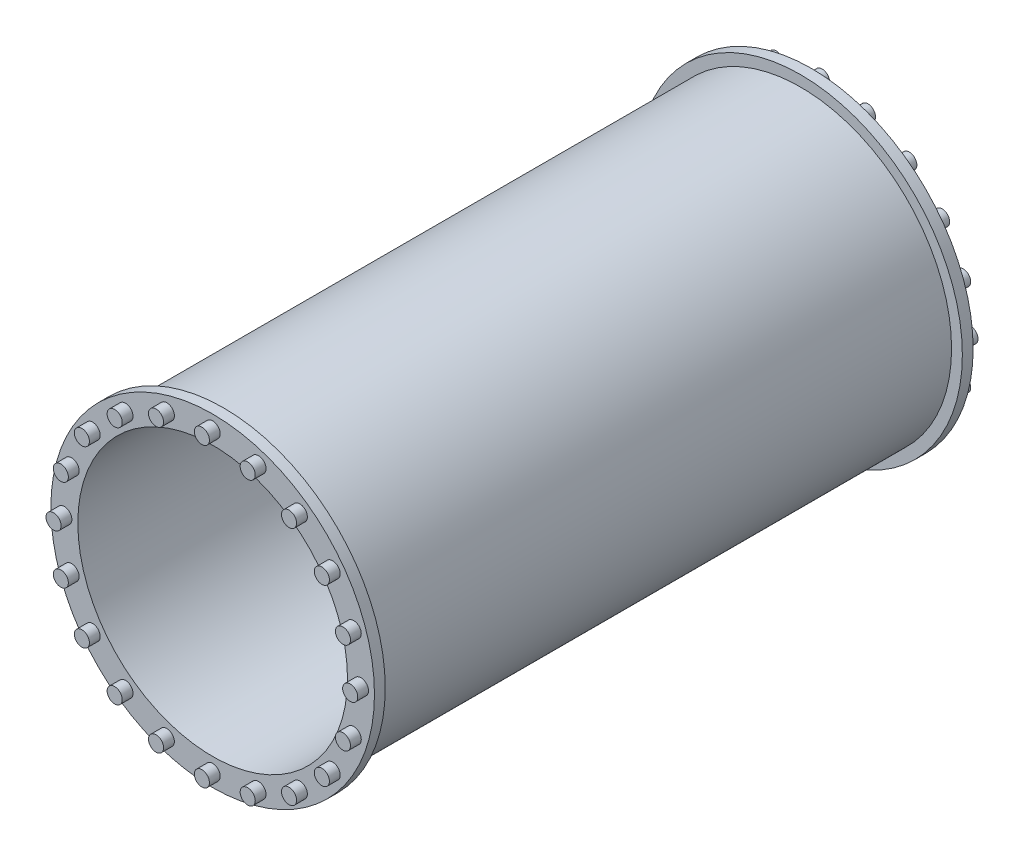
ISO-10303-21;
HEADER;
FILE_DESCRIPTION(('STEP AP214'),'2;1');
FILE_NAME('part.step','',(''),(''),'','','');
FILE_SCHEMA(('AUTOMOTIVE_DESIGN { 1 0 10303 214 1 1 1 1 }'));
ENDSEC;
DATA;
#1=APPLICATION_CONTEXT('core data for automotive mechanical design processes');
#2=APPLICATION_PROTOCOL_DEFINITION('international standard','automotive_design',2000,#1);
#3=PRODUCT_CONTEXT('',#1,'mechanical');
#4=PRODUCT('Part','Part','',(#3));
#5=PRODUCT_RELATED_PRODUCT_CATEGORY('part','',(#4));
#6=PRODUCT_DEFINITION_FORMATION('','',#4);
#7=PRODUCT_DEFINITION_CONTEXT('part definition',#1,'design');
#8=PRODUCT_DEFINITION('design','',#6,#7);
#9=PRODUCT_DEFINITION_SHAPE('','',#8);
#10=(LENGTH_UNIT() NAMED_UNIT(*) SI_UNIT(.MILLI.,.METRE.));
#11=(NAMED_UNIT(*) PLANE_ANGLE_UNIT() SI_UNIT($,.RADIAN.));
#12=(NAMED_UNIT(*) SI_UNIT($,.STERADIAN.) SOLID_ANGLE_UNIT());
#13=UNCERTAINTY_MEASURE_WITH_UNIT(LENGTH_MEASURE(1.E-05),#10,'distance_accuracy_value','');
#14=(GEOMETRIC_REPRESENTATION_CONTEXT(3) GLOBAL_UNCERTAINTY_ASSIGNED_CONTEXT((#13)) GLOBAL_UNIT_ASSIGNED_CONTEXT((#10,
#11,#12)) REPRESENTATION_CONTEXT('',''));
#15=CARTESIAN_POINT('',(0.,0.,0.));
#16=DIRECTION('',(0.,0.,1.));
#17=DIRECTION('',(1.,0.,0.));
#18=AXIS2_PLACEMENT_3D('',#15,#16,#17);
#19=CARTESIAN_POINT('',(0.,0.,10.));
#20=DIRECTION('',(0.,0.,1.));
#21=DIRECTION('',(1.,0.,0.));
#22=AXIS2_PLACEMENT_3D('',#19,#20,#21);
#23=PLANE('',#22);
#24=CARTESIAN_POINT('',(42.4898367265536,130.770270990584,10.));
#25=DIRECTION('',(0.,0.,1.));
#26=DIRECTION('',(0.951056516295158,-0.309016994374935,0.));
#27=AXIS2_PLACEMENT_3D('',#24,#25,#26);
#28=CIRCLE('',#27,7.);
#29=CARTESIAN_POINT('',(49.1472323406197,128.60715202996,10.));
#30=VERTEX_POINT('',#29);
#31=EDGE_CURVE('E57',#30,#30,#28,.T.);
#32=ORIENTED_EDGE('',*,*,#31,.F.);
#33=EDGE_LOOP('',(#32));
#34=FACE_BOUND('',#33,.T.);
#35=CARTESIAN_POINT('',(80.8204721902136,111.239836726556,10.));
#36=DIRECTION('',(0.,0.,1.));
#37=DIRECTION('',(0.809016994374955,-0.587785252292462,0.));
#38=AXIS2_PLACEMENT_3D('',#35,#36,#37);
#39=CIRCLE('',#38,7.);
#40=CARTESIAN_POINT('',(86.4835911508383,107.125339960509,10.));
#41=VERTEX_POINT('',#40);
#42=EDGE_CURVE('E56',#41,#41,#39,.T.);
#43=ORIENTED_EDGE('',*,*,#42,.F.);
#44=EDGE_LOOP('',(#43));
#45=FACE_BOUND('',#44,.T.);
#46=CARTESIAN_POINT('',(111.239836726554,80.8204721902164,10.));
#47=DIRECTION('',(0.,0.,1.));
#48=DIRECTION('',(0.587785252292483,-0.80901699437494,0.));
#49=AXIS2_PLACEMENT_3D('',#46,#47,#48);
#50=CIRCLE('',#49,7.);
#51=CARTESIAN_POINT('',(115.354333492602,75.1573532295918,10.));
#52=VERTEX_POINT('',#51);
#53=EDGE_CURVE('E63',#52,#52,#50,.T.);
#54=ORIENTED_EDGE('',*,*,#53,.F.);
#55=EDGE_LOOP('',(#54));
#56=FACE_BOUND('',#55,.T.);
#57=CARTESIAN_POINT('',(130.770270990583,42.4898367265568,10.));
#58=DIRECTION('',(0.,0.,1.));
#59=DIRECTION('',(0.309016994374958,-0.95105651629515,0.));
#60=AXIS2_PLACEMENT_3D('',#57,#58,#59);
#61=CIRCLE('',#60,7.);
#62=CARTESIAN_POINT('',(132.933389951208,35.8324411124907,10.));
#63=VERTEX_POINT('',#62);
#64=EDGE_CURVE('E69',#63,#63,#61,.T.);
#65=ORIENTED_EDGE('',*,*,#64,.F.);
#66=EDGE_LOOP('',(#65));
#67=FACE_BOUND('',#66,.T.);
#68=CARTESIAN_POINT('',(137.5,1.44023605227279E-12,10.));
#69=DIRECTION('',(0.,0.,1.));
#70=DIRECTION('',(0.,-1.,0.));
#71=AXIS2_PLACEMENT_3D('',#68,#69,#70);
#72=CIRCLE('',#71,7.);
#73=CARTESIAN_POINT('',(137.5,-6.99999999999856,10.));
#74=VERTEX_POINT('',#73);
#75=EDGE_CURVE('E75',#74,#74,#72,.T.);
#76=ORIENTED_EDGE('',*,*,#75,.F.);
#77=EDGE_LOOP('',(#76));
#78=FACE_BOUND('',#77,.T.);
#79=CARTESIAN_POINT('',(130.770270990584,-42.489836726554,10.));
#80=DIRECTION('',(0.,0.,1.));
#81=DIRECTION('',(-0.309016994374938,-0.951056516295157,0.));
#82=AXIS2_PLACEMENT_3D('',#79,#80,#81);
#83=CIRCLE('',#82,7.);
#84=CARTESIAN_POINT('',(128.607152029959,-49.1472323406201,10.));
#85=VERTEX_POINT('',#84);
#86=EDGE_CURVE('E81',#85,#85,#83,.T.);
#87=ORIENTED_EDGE('',*,*,#86,.F.);
#88=EDGE_LOOP('',(#87));
#89=FACE_BOUND('',#88,.T.);
#90=CARTESIAN_POINT('',(111.239836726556,-80.820472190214,10.));
#91=DIRECTION('',(0.,0.,1.));
#92=DIRECTION('',(-0.587785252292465,-0.809016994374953,0.));
#93=AXIS2_PLACEMENT_3D('',#90,#91,#92);
#94=CIRCLE('',#93,7.);
#95=CARTESIAN_POINT('',(107.125339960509,-86.4835911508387,10.));
#96=VERTEX_POINT('',#95);
#97=EDGE_CURVE('E87',#96,#96,#94,.T.);
#98=ORIENTED_EDGE('',*,*,#97,.F.);
#99=EDGE_LOOP('',(#98));
#100=FACE_BOUND('',#99,.T.);
#101=CARTESIAN_POINT('',(80.820472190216,-111.239836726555,10.));
#102=DIRECTION('',(0.,0.,1.));
#103=DIRECTION('',(-0.809016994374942,-0.58778525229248,0.));
#104=AXIS2_PLACEMENT_3D('',#101,#102,#103);
#105=CIRCLE('',#104,7.);
#106=CARTESIAN_POINT('',(75.1573532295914,-115.354333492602,10.));
#107=VERTEX_POINT('',#106);
#108=EDGE_CURVE('E93',#107,#107,#105,.T.);
#109=ORIENTED_EDGE('',*,*,#108,.F.);
#110=EDGE_LOOP('',(#109));
#111=FACE_BOUND('',#110,.T.);
#112=CARTESIAN_POINT('',(42.4898367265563,-130.770270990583,10.));
#113=DIRECTION('',(0.,0.,1.));
#114=DIRECTION('',(-0.951056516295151,-0.309016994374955,0.));
#115=AXIS2_PLACEMENT_3D('',#112,#113,#114);
#116=CIRCLE('',#115,7.);
#117=CARTESIAN_POINT('',(35.8324411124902,-132.933389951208,10.));
#118=VERTEX_POINT('',#117);
#119=EDGE_CURVE('E99',#118,#118,#116,.T.);
#120=ORIENTED_EDGE('',*,*,#119,.F.);
#121=EDGE_LOOP('',(#120));
#122=FACE_BOUND('',#121,.T.);
#123=CARTESIAN_POINT('',(0.,-137.5,10.));
#124=DIRECTION('',(0.,0.,1.));
#125=DIRECTION('',(-1.,0.,0.));
#126=AXIS2_PLACEMENT_3D('',#123,#124,#125);
#127=CIRCLE('',#126,7.);
#128=CARTESIAN_POINT('',(-7.,-137.5,10.));
#129=VERTEX_POINT('',#128);
#130=EDGE_CURVE('E105',#129,#129,#127,.T.);
#131=ORIENTED_EDGE('',*,*,#130,.F.);
#132=EDGE_LOOP('',(#131));
#133=FACE_BOUND('',#132,.T.);
#134=CARTESIAN_POINT('',(-42.4898367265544,-130.770270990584,10.));
#135=DIRECTION('',(0.,0.,1.));
#136=DIRECTION('',(-0.951056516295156,0.309016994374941,0.));
#137=AXIS2_PLACEMENT_3D('',#134,#135,#136);
#138=CIRCLE('',#137,7.);
#139=CARTESIAN_POINT('',(-49.1472323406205,-128.607152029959,10.));
#140=VERTEX_POINT('',#139);
#141=EDGE_CURVE('E111',#140,#140,#138,.T.);
#142=ORIENTED_EDGE('',*,*,#141,.F.);
#143=EDGE_LOOP('',(#142));
#144=FACE_BOUND('',#143,.T.);
#145=CARTESIAN_POINT('',(-80.8204721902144,-111.239836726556,10.));
#146=DIRECTION('',(0.,0.,1.));
#147=DIRECTION('',(-0.809016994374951,0.587785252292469,0.));
#148=AXIS2_PLACEMENT_3D('',#145,#146,#147);
#149=CIRCLE('',#148,7.);
#150=CARTESIAN_POINT('',(-86.4835911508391,-107.125339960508,10.));
#151=VERTEX_POINT('',#150);
#152=EDGE_CURVE('E117',#151,#151,#149,.T.);
#153=ORIENTED_EDGE('',*,*,#152,.F.);
#154=EDGE_LOOP('',(#153));
#155=FACE_BOUND('',#154,.T.);
#156=CARTESIAN_POINT('',(-111.239836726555,-80.8204721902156,10.));
#157=DIRECTION('',(0.,0.,1.));
#158=DIRECTION('',(-0.587785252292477,0.809016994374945,0.));
#159=AXIS2_PLACEMENT_3D('',#156,#157,#158);
#160=CIRCLE('',#159,7.);
#161=CARTESIAN_POINT('',(-115.354333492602,-75.157353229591,10.));
#162=VERTEX_POINT('',#161);
#163=EDGE_CURVE('E123',#162,#162,#160,.T.);
#164=ORIENTED_EDGE('',*,*,#163,.F.);
#165=EDGE_LOOP('',(#164));
#166=FACE_BOUND('',#165,.T.);
#167=CARTESIAN_POINT('',(-130.770270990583,-42.4898367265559,10.));
#168=DIRECTION('',(0.,0.,1.));
#169=DIRECTION('',(-0.309016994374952,0.951056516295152,0.));
#170=AXIS2_PLACEMENT_3D('',#167,#168,#169);
#171=CIRCLE('',#170,7.);
#172=CARTESIAN_POINT('',(-132.933389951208,-35.8324411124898,10.));
#173=VERTEX_POINT('',#172);
#174=EDGE_CURVE('E129',#173,#173,#171,.T.);
#175=ORIENTED_EDGE('',*,*,#174,.F.);
#176=EDGE_LOOP('',(#175));
#177=FACE_BOUND('',#176,.T.);
#178=CARTESIAN_POINT('',(-137.5,-4.80078684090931E-13,10.));
#179=DIRECTION('',(0.,0.,1.));
#180=DIRECTION('',(0.,1.,0.));
#181=AXIS2_PLACEMENT_3D('',#178,#179,#180);
#182=CIRCLE('',#181,7.);
#183=CARTESIAN_POINT('',(-137.5,6.99999999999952,10.));
#184=VERTEX_POINT('',#183);
#185=EDGE_CURVE('E135',#184,#184,#182,.T.);
#186=ORIENTED_EDGE('',*,*,#185,.F.);
#187=EDGE_LOOP('',(#186));
#188=FACE_BOUND('',#187,.T.);
#189=CARTESIAN_POINT('',(-130.770270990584,42.4898367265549,10.));
#190=DIRECTION('',(0.,0.,1.));
#191=DIRECTION('',(0.309016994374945,0.951056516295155,0.));
#192=AXIS2_PLACEMENT_3D('',#189,#190,#191);
#193=CIRCLE('',#192,7.);
#194=CARTESIAN_POINT('',(-128.607152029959,49.147232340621,10.));
#195=VERTEX_POINT('',#194);
#196=EDGE_CURVE('E141',#195,#195,#193,.T.);
#197=ORIENTED_EDGE('',*,*,#196,.F.);
#198=EDGE_LOOP('',(#197));
#199=FACE_BOUND('',#198,.T.);
#200=CARTESIAN_POINT('',(-111.239836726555,80.8204721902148,10.));
#201=DIRECTION('',(0.,0.,1.));
#202=DIRECTION('',(0.587785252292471,0.809016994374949,0.));
#203=AXIS2_PLACEMENT_3D('',#200,#201,#202);
#204=CIRCLE('',#203,7.);
#205=CARTESIAN_POINT('',(-107.125339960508,86.4835911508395,10.));
#206=VERTEX_POINT('',#205);
#207=EDGE_CURVE('E147',#206,#206,#204,.T.);
#208=ORIENTED_EDGE('',*,*,#207,.F.);
#209=EDGE_LOOP('',(#208));
#210=FACE_BOUND('',#209,.T.);
#211=CARTESIAN_POINT('',(-80.8204721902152,111.239836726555,10.));
#212=DIRECTION('',(0.,0.,1.));
#213=DIRECTION('',(0.809016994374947,0.587785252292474,0.));
#214=AXIS2_PLACEMENT_3D('',#211,#212,#213);
#215=CIRCLE('',#214,7.);
#216=CARTESIAN_POINT('',(-75.1573532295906,115.354333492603,10.));
#217=VERTEX_POINT('',#216);
#218=EDGE_CURVE('E153',#217,#217,#215,.T.);
#219=ORIENTED_EDGE('',*,*,#218,.F.);
#220=EDGE_LOOP('',(#219));
#221=FACE_BOUND('',#220,.T.);
#222=CARTESIAN_POINT('',(-42.4898367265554,130.770270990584,10.));
#223=DIRECTION('',(0.,0.,1.));
#224=DIRECTION('',(0.951056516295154,0.309016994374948,0.));
#225=AXIS2_PLACEMENT_3D('',#222,#223,#224);
#226=CIRCLE('',#225,7.);
#227=CARTESIAN_POINT('',(-35.8324411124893,132.933389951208,10.));
#228=VERTEX_POINT('',#227);
#229=EDGE_CURVE('E159',#228,#228,#226,.T.);
#230=ORIENTED_EDGE('',*,*,#229,.F.);
#231=EDGE_LOOP('',(#230));
#232=FACE_BOUND('',#231,.T.);
#233=CARTESIAN_POINT('',(0.,137.5,10.));
#234=DIRECTION('',(0.,0.,1.));
#235=DIRECTION('',(1.,0.,0.));
#236=AXIS2_PLACEMENT_3D('',#233,#234,#235);
#237=CIRCLE('',#236,7.);
#238=CARTESIAN_POINT('',(7.,137.5,10.));
#239=VERTEX_POINT('',#238);
#240=EDGE_CURVE('E165',#239,#239,#237,.T.);
#241=ORIENTED_EDGE('',*,*,#240,.F.);
#242=EDGE_LOOP('',(#241));
#243=FACE_BOUND('',#242,.T.);
#244=CARTESIAN_POINT('',(0.,0.,10.));
#245=DIRECTION('',(0.,0.,1.));
#246=DIRECTION('',(1.,0.,0.));
#247=AXIS2_PLACEMENT_3D('',#244,#245,#246);
#248=CIRCLE('',#247,150.);
#249=CARTESIAN_POINT('',(150.,0.,10.));
#250=VERTEX_POINT('',#249);
#251=EDGE_CURVE('E44',#250,#250,#248,.T.);
#252=ORIENTED_EDGE('',*,*,#251,.T.);
#253=EDGE_LOOP('',(#252));
#254=FACE_BOUND('',#253,.T.);
#255=CARTESIAN_POINT('',(0.,0.,10.));
#256=DIRECTION('',(0.,0.,1.));
#257=DIRECTION('',(1.,0.,0.));
#258=AXIS2_PLACEMENT_3D('',#255,#256,#257);
#259=CIRCLE('',#258,125.);
#260=CARTESIAN_POINT('',(125.,0.,10.));
#261=VERTEX_POINT('',#260);
#262=EDGE_CURVE('E171',#261,#261,#259,.T.);
#263=ORIENTED_EDGE('',*,*,#262,.F.);
#264=EDGE_LOOP('',(#263));
#265=FACE_BOUND('',#264,.T.);
#266=ADVANCED_FACE('F36',(#34,#45,#56,#67,#78,#89,#100,#111,#122,#133,#144,#155,#166,#177,#188,
#199,#210,#221,#232,#243,#254,#265),#23,.T.);
#267=CARTESIAN_POINT('',(0.,0.,0.));
#268=DIRECTION('',(0.,0.,1.));
#269=DIRECTION('',(1.,0.,0.));
#270=AXIS2_PLACEMENT_3D('',#267,#268,#269);
#271=PLANE('',#270);
#272=CARTESIAN_POINT('',(0.,0.,0.));
#273=DIRECTION('',(0.,0.,-1.));
#274=DIRECTION('',(-1.,0.,0.));
#275=AXIS2_PLACEMENT_3D('',#272,#273,#274);
#276=CIRCLE('',#275,140.);
#277=CARTESIAN_POINT('',(-140.,0.,0.));
#278=VERTEX_POINT('',#277);
#279=EDGE_CURVE('E10',#278,#278,#276,.T.);
#280=ORIENTED_EDGE('',*,*,#279,.F.);
#281=EDGE_LOOP('',(#280));
#282=FACE_BOUND('',#281,.T.);
#283=CARTESIAN_POINT('',(0.,0.,0.));
#284=DIRECTION('',(0.,0.,1.));
#285=DIRECTION('',(1.,0.,0.));
#286=AXIS2_PLACEMENT_3D('',#283,#284,#285);
#287=CIRCLE('',#286,150.);
#288=CARTESIAN_POINT('',(150.,0.,0.));
#289=VERTEX_POINT('',#288);
#290=EDGE_CURVE('E40',#289,#289,#287,.T.);
#291=ORIENTED_EDGE('',*,*,#290,.F.);
#292=EDGE_LOOP('',(#291));
#293=FACE_BOUND('',#292,.T.);
#294=ADVANCED_FACE('F181',(#282,#293),#271,.F.);
#295=CARTESIAN_POINT('',(0.,0.,10.));
#296=DIRECTION('',(0.,0.,-1.));
#297=DIRECTION('',(-1.,0.,0.));
#298=AXIS2_PLACEMENT_3D('',#295,#296,#297);
#299=CYLINDRICAL_SURFACE('',#298,150.);
#300=ORIENTED_EDGE('',*,*,#251,.F.);
#301=EDGE_LOOP('',(#300));
#302=FACE_BOUND('',#301,.T.);
#303=ORIENTED_EDGE('',*,*,#290,.T.);
#304=EDGE_LOOP('',(#303));
#305=FACE_BOUND('',#304,.T.);
#306=ADVANCED_FACE('F38',(#302,#305),#299,.T.);
#307=CARTESIAN_POINT('',(0.,0.,10.));
#308=DIRECTION('',(0.,0.,-1.));
#309=DIRECTION('',(-1.,0.,0.));
#310=AXIS2_PLACEMENT_3D('',#307,#308,#309);
#311=CYLINDRICAL_SURFACE('',#310,125.);
#312=ORIENTED_EDGE('',*,*,#262,.T.);
#313=EDGE_LOOP('',(#312));
#314=FACE_BOUND('',#313,.T.);
#315=CARTESIAN_POINT('',(0.,0.,-545.));
#316=DIRECTION('',(0.,0.,-1.));
#317=DIRECTION('',(-1.,0.,0.));
#318=AXIS2_PLACEMENT_3D('',#315,#316,#317);
#319=CIRCLE('',#318,125.);
#320=CARTESIAN_POINT('',(-125.,0.,-545.));
#321=VERTEX_POINT('',#320);
#322=EDGE_CURVE('E652',#321,#321,#319,.T.);
#323=ORIENTED_EDGE('',*,*,#322,.T.);
#324=EDGE_LOOP('',(#323));
#325=FACE_BOUND('',#324,.T.);
#326=ADVANCED_FACE('F188',(#314,#325),#311,.F.);
#327=CARTESIAN_POINT('',(0.,137.5,20.));
#328=DIRECTION('',(0.,0.,-1.));
#329=DIRECTION('',(-1.,0.,0.));
#330=AXIS2_PLACEMENT_3D('',#327,#328,#329);
#331=CYLINDRICAL_SURFACE('',#330,7.);
#332=CARTESIAN_POINT('',(0.,137.5,20.));
#333=DIRECTION('',(0.,0.,1.));
#334=DIRECTION('',(1.,0.,0.));
#335=AXIS2_PLACEMENT_3D('',#332,#333,#334);
#336=CIRCLE('',#335,7.);
#337=CARTESIAN_POINT('',(7.,137.5,20.));
#338=VERTEX_POINT('',#337);
#339=EDGE_CURVE('E168',#338,#338,#336,.T.);
#340=ORIENTED_EDGE('',*,*,#339,.F.);
#341=EDGE_LOOP('',(#340));
#342=FACE_BOUND('',#341,.T.);
#343=ORIENTED_EDGE('',*,*,#240,.T.);
#344=EDGE_LOOP('',(#343));
#345=FACE_BOUND('',#344,.T.);
#346=ADVANCED_FACE('F195',(#342,#345),#331,.T.);
#347=CARTESIAN_POINT('',(0.,137.5,20.));
#348=DIRECTION('',(0.,0.,1.));
#349=DIRECTION('',(1.,0.,0.));
#350=AXIS2_PLACEMENT_3D('',#347,#348,#349);
#351=PLANE('',#350);
#352=ORIENTED_EDGE('',*,*,#339,.T.);
#353=EDGE_LOOP('',(#352));
#354=FACE_BOUND('',#353,.T.);
#355=ADVANCED_FACE('F198',(#354),#351,.T.);
#356=CARTESIAN_POINT('',(-42.4898367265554,130.770270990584,20.));
#357=DIRECTION('',(0.,0.,-1.));
#358=DIRECTION('',(-1.,0.,0.));
#359=AXIS2_PLACEMENT_3D('',#356,#357,#358);
#360=CYLINDRICAL_SURFACE('',#359,7.);
#361=CARTESIAN_POINT('',(-42.4898367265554,130.770270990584,20.));
#362=DIRECTION('',(0.,0.,1.));
#363=DIRECTION('',(0.951056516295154,0.309016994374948,0.));
#364=AXIS2_PLACEMENT_3D('',#361,#362,#363);
#365=CIRCLE('',#364,7.);
#366=CARTESIAN_POINT('',(-35.8324411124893,132.933389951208,20.));
#367=VERTEX_POINT('',#366);
#368=EDGE_CURVE('E162',#367,#367,#365,.T.);
#369=ORIENTED_EDGE('',*,*,#368,.F.);
#370=EDGE_LOOP('',(#369));
#371=FACE_BOUND('',#370,.T.);
#372=ORIENTED_EDGE('',*,*,#229,.T.);
#373=EDGE_LOOP('',(#372));
#374=FACE_BOUND('',#373,.T.);
#375=ADVANCED_FACE('F202',(#371,#374),#360,.T.);
#376=CARTESIAN_POINT('',(-42.4898367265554,130.770270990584,20.));
#377=DIRECTION('',(0.,0.,1.));
#378=DIRECTION('',(0.951056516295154,0.309016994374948,0.));
#379=AXIS2_PLACEMENT_3D('',#376,#377,#378);
#380=PLANE('',#379);
#381=ORIENTED_EDGE('',*,*,#368,.T.);
#382=EDGE_LOOP('',(#381));
#383=FACE_BOUND('',#382,.T.);
#384=ADVANCED_FACE('F206',(#383),#380,.T.);
#385=CARTESIAN_POINT('',(-80.8204721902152,111.239836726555,20.));
#386=DIRECTION('',(0.,0.,-1.));
#387=DIRECTION('',(-1.,0.,0.));
#388=AXIS2_PLACEMENT_3D('',#385,#386,#387);
#389=CYLINDRICAL_SURFACE('',#388,7.);
#390=CARTESIAN_POINT('',(-80.8204721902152,111.239836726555,20.));
#391=DIRECTION('',(0.,0.,1.));
#392=DIRECTION('',(0.809016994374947,0.587785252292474,0.));
#393=AXIS2_PLACEMENT_3D('',#390,#391,#392);
#394=CIRCLE('',#393,7.);
#395=CARTESIAN_POINT('',(-75.1573532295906,115.354333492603,20.));
#396=VERTEX_POINT('',#395);
#397=EDGE_CURVE('E156',#396,#396,#394,.T.);
#398=ORIENTED_EDGE('',*,*,#397,.F.);
#399=EDGE_LOOP('',(#398));
#400=FACE_BOUND('',#399,.T.);
#401=ORIENTED_EDGE('',*,*,#218,.T.);
#402=EDGE_LOOP('',(#401));
#403=FACE_BOUND('',#402,.T.);
#404=ADVANCED_FACE('F210',(#400,#403),#389,.T.);
#405=CARTESIAN_POINT('',(-80.8204721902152,111.239836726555,20.));
#406=DIRECTION('',(0.,0.,1.));
#407=DIRECTION('',(0.809016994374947,0.587785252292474,0.));
#408=AXIS2_PLACEMENT_3D('',#405,#406,#407);
#409=PLANE('',#408);
#410=ORIENTED_EDGE('',*,*,#397,.T.);
#411=EDGE_LOOP('',(#410));
#412=FACE_BOUND('',#411,.T.);
#413=ADVANCED_FACE('F214',(#412),#409,.T.);
#414=CARTESIAN_POINT('',(-111.239836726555,80.8204721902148,20.));
#415=DIRECTION('',(0.,0.,-1.));
#416=DIRECTION('',(-1.,0.,0.));
#417=AXIS2_PLACEMENT_3D('',#414,#415,#416);
#418=CYLINDRICAL_SURFACE('',#417,7.);
#419=CARTESIAN_POINT('',(-111.239836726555,80.8204721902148,20.));
#420=DIRECTION('',(0.,0.,1.));
#421=DIRECTION('',(0.587785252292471,0.809016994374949,0.));
#422=AXIS2_PLACEMENT_3D('',#419,#420,#421);
#423=CIRCLE('',#422,7.);
#424=CARTESIAN_POINT('',(-107.125339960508,86.4835911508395,20.));
#425=VERTEX_POINT('',#424);
#426=EDGE_CURVE('E150',#425,#425,#423,.T.);
#427=ORIENTED_EDGE('',*,*,#426,.F.);
#428=EDGE_LOOP('',(#427));
#429=FACE_BOUND('',#428,.T.);
#430=ORIENTED_EDGE('',*,*,#207,.T.);
#431=EDGE_LOOP('',(#430));
#432=FACE_BOUND('',#431,.T.);
#433=ADVANCED_FACE('F218',(#429,#432),#418,.T.);
#434=CARTESIAN_POINT('',(-111.239836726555,80.8204721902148,20.));
#435=DIRECTION('',(0.,0.,1.));
#436=DIRECTION('',(0.587785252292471,0.809016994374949,0.));
#437=AXIS2_PLACEMENT_3D('',#434,#435,#436);
#438=PLANE('',#437);
#439=ORIENTED_EDGE('',*,*,#426,.T.);
#440=EDGE_LOOP('',(#439));
#441=FACE_BOUND('',#440,.T.);
#442=ADVANCED_FACE('F222',(#441),#438,.T.);
#443=CARTESIAN_POINT('',(-130.770270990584,42.4898367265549,20.));
#444=DIRECTION('',(0.,0.,-1.));
#445=DIRECTION('',(-1.,0.,0.));
#446=AXIS2_PLACEMENT_3D('',#443,#444,#445);
#447=CYLINDRICAL_SURFACE('',#446,7.);
#448=CARTESIAN_POINT('',(-130.770270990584,42.4898367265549,20.));
#449=DIRECTION('',(0.,0.,1.));
#450=DIRECTION('',(0.309016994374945,0.951056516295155,0.));
#451=AXIS2_PLACEMENT_3D('',#448,#449,#450);
#452=CIRCLE('',#451,7.);
#453=CARTESIAN_POINT('',(-128.607152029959,49.147232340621,20.));
#454=VERTEX_POINT('',#453);
#455=EDGE_CURVE('E144',#454,#454,#452,.T.);
#456=ORIENTED_EDGE('',*,*,#455,.F.);
#457=EDGE_LOOP('',(#456));
#458=FACE_BOUND('',#457,.T.);
#459=ORIENTED_EDGE('',*,*,#196,.T.);
#460=EDGE_LOOP('',(#459));
#461=FACE_BOUND('',#460,.T.);
#462=ADVANCED_FACE('F226',(#458,#461),#447,.T.);
#463=CARTESIAN_POINT('',(-130.770270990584,42.4898367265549,20.));
#464=DIRECTION('',(0.,0.,1.));
#465=DIRECTION('',(0.309016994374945,0.951056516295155,0.));
#466=AXIS2_PLACEMENT_3D('',#463,#464,#465);
#467=PLANE('',#466);
#468=ORIENTED_EDGE('',*,*,#455,.T.);
#469=EDGE_LOOP('',(#468));
#470=FACE_BOUND('',#469,.T.);
#471=ADVANCED_FACE('F230',(#470),#467,.T.);
#472=CARTESIAN_POINT('',(-137.5,-4.80078684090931E-13,20.));
#473=DIRECTION('',(0.,0.,-1.));
#474=DIRECTION('',(-1.,0.,0.));
#475=AXIS2_PLACEMENT_3D('',#472,#473,#474);
#476=CYLINDRICAL_SURFACE('',#475,7.);
#477=CARTESIAN_POINT('',(-137.5,-4.80078684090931E-13,20.));
#478=DIRECTION('',(0.,0.,1.));
#479=DIRECTION('',(0.,1.,0.));
#480=AXIS2_PLACEMENT_3D('',#477,#478,#479);
#481=CIRCLE('',#480,7.);
#482=CARTESIAN_POINT('',(-137.5,6.99999999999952,20.));
#483=VERTEX_POINT('',#482);
#484=EDGE_CURVE('E138',#483,#483,#481,.T.);
#485=ORIENTED_EDGE('',*,*,#484,.F.);
#486=EDGE_LOOP('',(#485));
#487=FACE_BOUND('',#486,.T.);
#488=ORIENTED_EDGE('',*,*,#185,.T.);
#489=EDGE_LOOP('',(#488));
#490=FACE_BOUND('',#489,.T.);
#491=ADVANCED_FACE('F234',(#487,#490),#476,.T.);
#492=CARTESIAN_POINT('',(-137.5,-4.80078684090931E-13,20.));
#493=DIRECTION('',(0.,0.,1.));
#494=DIRECTION('',(0.,1.,0.));
#495=AXIS2_PLACEMENT_3D('',#492,#493,#494);
#496=PLANE('',#495);
#497=ORIENTED_EDGE('',*,*,#484,.T.);
#498=EDGE_LOOP('',(#497));
#499=FACE_BOUND('',#498,.T.);
#500=ADVANCED_FACE('F238',(#499),#496,.T.);
#501=CARTESIAN_POINT('',(-130.770270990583,-42.4898367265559,20.));
#502=DIRECTION('',(0.,0.,-1.));
#503=DIRECTION('',(-1.,0.,0.));
#504=AXIS2_PLACEMENT_3D('',#501,#502,#503);
#505=CYLINDRICAL_SURFACE('',#504,7.);
#506=CARTESIAN_POINT('',(-130.770270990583,-42.4898367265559,20.));
#507=DIRECTION('',(0.,0.,1.));
#508=DIRECTION('',(-0.309016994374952,0.951056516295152,0.));
#509=AXIS2_PLACEMENT_3D('',#506,#507,#508);
#510=CIRCLE('',#509,7.);
#511=CARTESIAN_POINT('',(-132.933389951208,-35.8324411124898,20.));
#512=VERTEX_POINT('',#511);
#513=EDGE_CURVE('E132',#512,#512,#510,.T.);
#514=ORIENTED_EDGE('',*,*,#513,.F.);
#515=EDGE_LOOP('',(#514));
#516=FACE_BOUND('',#515,.T.);
#517=ORIENTED_EDGE('',*,*,#174,.T.);
#518=EDGE_LOOP('',(#517));
#519=FACE_BOUND('',#518,.T.);
#520=ADVANCED_FACE('F242',(#516,#519),#505,.T.);
#521=CARTESIAN_POINT('',(-130.770270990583,-42.4898367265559,20.));
#522=DIRECTION('',(0.,0.,1.));
#523=DIRECTION('',(-0.309016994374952,0.951056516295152,0.));
#524=AXIS2_PLACEMENT_3D('',#521,#522,#523);
#525=PLANE('',#524);
#526=ORIENTED_EDGE('',*,*,#513,.T.);
#527=EDGE_LOOP('',(#526));
#528=FACE_BOUND('',#527,.T.);
#529=ADVANCED_FACE('F246',(#528),#525,.T.);
#530=CARTESIAN_POINT('',(-111.239836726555,-80.8204721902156,20.));
#531=DIRECTION('',(0.,0.,-1.));
#532=DIRECTION('',(-1.,0.,0.));
#533=AXIS2_PLACEMENT_3D('',#530,#531,#532);
#534=CYLINDRICAL_SURFACE('',#533,7.);
#535=CARTESIAN_POINT('',(-111.239836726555,-80.8204721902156,20.));
#536=DIRECTION('',(0.,0.,1.));
#537=DIRECTION('',(-0.587785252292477,0.809016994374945,0.));
#538=AXIS2_PLACEMENT_3D('',#535,#536,#537);
#539=CIRCLE('',#538,7.);
#540=CARTESIAN_POINT('',(-115.354333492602,-75.157353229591,20.));
#541=VERTEX_POINT('',#540);
#542=EDGE_CURVE('E126',#541,#541,#539,.T.);
#543=ORIENTED_EDGE('',*,*,#542,.F.);
#544=EDGE_LOOP('',(#543));
#545=FACE_BOUND('',#544,.T.);
#546=ORIENTED_EDGE('',*,*,#163,.T.);
#547=EDGE_LOOP('',(#546));
#548=FACE_BOUND('',#547,.T.);
#549=ADVANCED_FACE('F250',(#545,#548),#534,.T.);
#550=CARTESIAN_POINT('',(-111.239836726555,-80.8204721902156,20.));
#551=DIRECTION('',(0.,0.,1.));
#552=DIRECTION('',(-0.587785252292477,0.809016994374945,0.));
#553=AXIS2_PLACEMENT_3D('',#550,#551,#552);
#554=PLANE('',#553);
#555=ORIENTED_EDGE('',*,*,#542,.T.);
#556=EDGE_LOOP('',(#555));
#557=FACE_BOUND('',#556,.T.);
#558=ADVANCED_FACE('F254',(#557),#554,.T.);
#559=CARTESIAN_POINT('',(-80.8204721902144,-111.239836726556,20.));
#560=DIRECTION('',(0.,0.,-1.));
#561=DIRECTION('',(-1.,0.,0.));
#562=AXIS2_PLACEMENT_3D('',#559,#560,#561);
#563=CYLINDRICAL_SURFACE('',#562,7.);
#564=CARTESIAN_POINT('',(-80.8204721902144,-111.239836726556,20.));
#565=DIRECTION('',(0.,0.,1.));
#566=DIRECTION('',(-0.809016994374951,0.587785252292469,0.));
#567=AXIS2_PLACEMENT_3D('',#564,#565,#566);
#568=CIRCLE('',#567,7.);
#569=CARTESIAN_POINT('',(-86.4835911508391,-107.125339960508,20.));
#570=VERTEX_POINT('',#569);
#571=EDGE_CURVE('E120',#570,#570,#568,.T.);
#572=ORIENTED_EDGE('',*,*,#571,.F.);
#573=EDGE_LOOP('',(#572));
#574=FACE_BOUND('',#573,.T.);
#575=ORIENTED_EDGE('',*,*,#152,.T.);
#576=EDGE_LOOP('',(#575));
#577=FACE_BOUND('',#576,.T.);
#578=ADVANCED_FACE('F258',(#574,#577),#563,.T.);
#579=CARTESIAN_POINT('',(-80.8204721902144,-111.239836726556,20.));
#580=DIRECTION('',(0.,0.,1.));
#581=DIRECTION('',(-0.809016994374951,0.587785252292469,0.));
#582=AXIS2_PLACEMENT_3D('',#579,#580,#581);
#583=PLANE('',#582);
#584=ORIENTED_EDGE('',*,*,#571,.T.);
#585=EDGE_LOOP('',(#584));
#586=FACE_BOUND('',#585,.T.);
#587=ADVANCED_FACE('F262',(#586),#583,.T.);
#588=CARTESIAN_POINT('',(-42.4898367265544,-130.770270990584,20.));
#589=DIRECTION('',(0.,0.,-1.));
#590=DIRECTION('',(-1.,0.,0.));
#591=AXIS2_PLACEMENT_3D('',#588,#589,#590);
#592=CYLINDRICAL_SURFACE('',#591,7.);
#593=CARTESIAN_POINT('',(-42.4898367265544,-130.770270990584,20.));
#594=DIRECTION('',(0.,0.,1.));
#595=DIRECTION('',(-0.951056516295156,0.309016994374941,0.));
#596=AXIS2_PLACEMENT_3D('',#593,#594,#595);
#597=CIRCLE('',#596,7.);
#598=CARTESIAN_POINT('',(-49.1472323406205,-128.607152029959,20.));
#599=VERTEX_POINT('',#598);
#600=EDGE_CURVE('E114',#599,#599,#597,.T.);
#601=ORIENTED_EDGE('',*,*,#600,.F.);
#602=EDGE_LOOP('',(#601));
#603=FACE_BOUND('',#602,.T.);
#604=ORIENTED_EDGE('',*,*,#141,.T.);
#605=EDGE_LOOP('',(#604));
#606=FACE_BOUND('',#605,.T.);
#607=ADVANCED_FACE('F266',(#603,#606),#592,.T.);
#608=CARTESIAN_POINT('',(-42.4898367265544,-130.770270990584,20.));
#609=DIRECTION('',(0.,0.,1.));
#610=DIRECTION('',(-0.951056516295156,0.309016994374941,0.));
#611=AXIS2_PLACEMENT_3D('',#608,#609,#610);
#612=PLANE('',#611);
#613=ORIENTED_EDGE('',*,*,#600,.T.);
#614=EDGE_LOOP('',(#613));
#615=FACE_BOUND('',#614,.T.);
#616=ADVANCED_FACE('F270',(#615),#612,.T.);
#617=CARTESIAN_POINT('',(0.,-137.5,20.));
#618=DIRECTION('',(0.,0.,-1.));
#619=DIRECTION('',(-1.,0.,0.));
#620=AXIS2_PLACEMENT_3D('',#617,#618,#619);
#621=CYLINDRICAL_SURFACE('',#620,7.);
#622=CARTESIAN_POINT('',(0.,-137.5,20.));
#623=DIRECTION('',(0.,0.,1.));
#624=DIRECTION('',(-1.,0.,0.));
#625=AXIS2_PLACEMENT_3D('',#622,#623,#624);
#626=CIRCLE('',#625,7.);
#627=CARTESIAN_POINT('',(-7.,-137.5,20.));
#628=VERTEX_POINT('',#627);
#629=EDGE_CURVE('E108',#628,#628,#626,.T.);
#630=ORIENTED_EDGE('',*,*,#629,.F.);
#631=EDGE_LOOP('',(#630));
#632=FACE_BOUND('',#631,.T.);
#633=ORIENTED_EDGE('',*,*,#130,.T.);
#634=EDGE_LOOP('',(#633));
#635=FACE_BOUND('',#634,.T.);
#636=ADVANCED_FACE('F274',(#632,#635),#621,.T.);
#637=CARTESIAN_POINT('',(0.,-137.5,20.));
#638=DIRECTION('',(0.,0.,1.));
#639=DIRECTION('',(-1.,0.,0.));
#640=AXIS2_PLACEMENT_3D('',#637,#638,#639);
#641=PLANE('',#640);
#642=ORIENTED_EDGE('',*,*,#629,.T.);
#643=EDGE_LOOP('',(#642));
#644=FACE_BOUND('',#643,.T.);
#645=ADVANCED_FACE('F278',(#644),#641,.T.);
#646=CARTESIAN_POINT('',(42.4898367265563,-130.770270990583,20.));
#647=DIRECTION('',(0.,0.,-1.));
#648=DIRECTION('',(-1.,0.,0.));
#649=AXIS2_PLACEMENT_3D('',#646,#647,#648);
#650=CYLINDRICAL_SURFACE('',#649,7.);
#651=CARTESIAN_POINT('',(42.4898367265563,-130.770270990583,20.));
#652=DIRECTION('',(0.,0.,1.));
#653=DIRECTION('',(-0.951056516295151,-0.309016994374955,0.));
#654=AXIS2_PLACEMENT_3D('',#651,#652,#653);
#655=CIRCLE('',#654,7.);
#656=CARTESIAN_POINT('',(35.8324411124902,-132.933389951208,20.));
#657=VERTEX_POINT('',#656);
#658=EDGE_CURVE('E102',#657,#657,#655,.T.);
#659=ORIENTED_EDGE('',*,*,#658,.F.);
#660=EDGE_LOOP('',(#659));
#661=FACE_BOUND('',#660,.T.);
#662=ORIENTED_EDGE('',*,*,#119,.T.);
#663=EDGE_LOOP('',(#662));
#664=FACE_BOUND('',#663,.T.);
#665=ADVANCED_FACE('F282',(#661,#664),#650,.T.);
#666=CARTESIAN_POINT('',(42.4898367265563,-130.770270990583,20.));
#667=DIRECTION('',(0.,0.,1.));
#668=DIRECTION('',(-0.951056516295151,-0.309016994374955,0.));
#669=AXIS2_PLACEMENT_3D('',#666,#667,#668);
#670=PLANE('',#669);
#671=ORIENTED_EDGE('',*,*,#658,.T.);
#672=EDGE_LOOP('',(#671));
#673=FACE_BOUND('',#672,.T.);
#674=ADVANCED_FACE('F286',(#673),#670,.T.);
#675=CARTESIAN_POINT('',(80.820472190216,-111.239836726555,20.));
#676=DIRECTION('',(0.,0.,-1.));
#677=DIRECTION('',(-1.,0.,0.));
#678=AXIS2_PLACEMENT_3D('',#675,#676,#677);
#679=CYLINDRICAL_SURFACE('',#678,7.);
#680=CARTESIAN_POINT('',(80.820472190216,-111.239836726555,20.));
#681=DIRECTION('',(0.,0.,1.));
#682=DIRECTION('',(-0.809016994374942,-0.58778525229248,0.));
#683=AXIS2_PLACEMENT_3D('',#680,#681,#682);
#684=CIRCLE('',#683,7.);
#685=CARTESIAN_POINT('',(75.1573532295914,-115.354333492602,20.));
#686=VERTEX_POINT('',#685);
#687=EDGE_CURVE('E96',#686,#686,#684,.T.);
#688=ORIENTED_EDGE('',*,*,#687,.F.);
#689=EDGE_LOOP('',(#688));
#690=FACE_BOUND('',#689,.T.);
#691=ORIENTED_EDGE('',*,*,#108,.T.);
#692=EDGE_LOOP('',(#691));
#693=FACE_BOUND('',#692,.T.);
#694=ADVANCED_FACE('F290',(#690,#693),#679,.T.);
#695=CARTESIAN_POINT('',(80.820472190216,-111.239836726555,20.));
#696=DIRECTION('',(0.,0.,1.));
#697=DIRECTION('',(-0.809016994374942,-0.58778525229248,0.));
#698=AXIS2_PLACEMENT_3D('',#695,#696,#697);
#699=PLANE('',#698);
#700=ORIENTED_EDGE('',*,*,#687,.T.);
#701=EDGE_LOOP('',(#700));
#702=FACE_BOUND('',#701,.T.);
#703=ADVANCED_FACE('F294',(#702),#699,.T.);
#704=CARTESIAN_POINT('',(111.239836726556,-80.820472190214,20.));
#705=DIRECTION('',(0.,0.,-1.));
#706=DIRECTION('',(-1.,0.,0.));
#707=AXIS2_PLACEMENT_3D('',#704,#705,#706);
#708=CYLINDRICAL_SURFACE('',#707,7.);
#709=CARTESIAN_POINT('',(111.239836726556,-80.820472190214,20.));
#710=DIRECTION('',(0.,0.,1.));
#711=DIRECTION('',(-0.587785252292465,-0.809016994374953,0.));
#712=AXIS2_PLACEMENT_3D('',#709,#710,#711);
#713=CIRCLE('',#712,7.);
#714=CARTESIAN_POINT('',(107.125339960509,-86.4835911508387,20.));
#715=VERTEX_POINT('',#714);
#716=EDGE_CURVE('E90',#715,#715,#713,.T.);
#717=ORIENTED_EDGE('',*,*,#716,.F.);
#718=EDGE_LOOP('',(#717));
#719=FACE_BOUND('',#718,.T.);
#720=ORIENTED_EDGE('',*,*,#97,.T.);
#721=EDGE_LOOP('',(#720));
#722=FACE_BOUND('',#721,.T.);
#723=ADVANCED_FACE('F298',(#719,#722),#708,.T.);
#724=CARTESIAN_POINT('',(111.239836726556,-80.820472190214,20.));
#725=DIRECTION('',(0.,0.,1.));
#726=DIRECTION('',(-0.587785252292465,-0.809016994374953,0.));
#727=AXIS2_PLACEMENT_3D('',#724,#725,#726);
#728=PLANE('',#727);
#729=ORIENTED_EDGE('',*,*,#716,.T.);
#730=EDGE_LOOP('',(#729));
#731=FACE_BOUND('',#730,.T.);
#732=ADVANCED_FACE('F302',(#731),#728,.T.);
#733=CARTESIAN_POINT('',(130.770270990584,-42.489836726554,20.));
#734=DIRECTION('',(0.,0.,-1.));
#735=DIRECTION('',(-1.,0.,0.));
#736=AXIS2_PLACEMENT_3D('',#733,#734,#735);
#737=CYLINDRICAL_SURFACE('',#736,7.);
#738=CARTESIAN_POINT('',(130.770270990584,-42.489836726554,20.));
#739=DIRECTION('',(0.,0.,1.));
#740=DIRECTION('',(-0.309016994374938,-0.951056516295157,0.));
#741=AXIS2_PLACEMENT_3D('',#738,#739,#740);
#742=CIRCLE('',#741,7.);
#743=CARTESIAN_POINT('',(128.607152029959,-49.1472323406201,20.));
#744=VERTEX_POINT('',#743);
#745=EDGE_CURVE('E84',#744,#744,#742,.T.);
#746=ORIENTED_EDGE('',*,*,#745,.F.);
#747=EDGE_LOOP('',(#746));
#748=FACE_BOUND('',#747,.T.);
#749=ORIENTED_EDGE('',*,*,#86,.T.);
#750=EDGE_LOOP('',(#749));
#751=FACE_BOUND('',#750,.T.);
#752=ADVANCED_FACE('F306',(#748,#751),#737,.T.);
#753=CARTESIAN_POINT('',(130.770270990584,-42.489836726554,20.));
#754=DIRECTION('',(0.,0.,1.));
#755=DIRECTION('',(-0.309016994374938,-0.951056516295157,0.));
#756=AXIS2_PLACEMENT_3D('',#753,#754,#755);
#757=PLANE('',#756);
#758=ORIENTED_EDGE('',*,*,#745,.T.);
#759=EDGE_LOOP('',(#758));
#760=FACE_BOUND('',#759,.T.);
#761=ADVANCED_FACE('F310',(#760),#757,.T.);
#762=CARTESIAN_POINT('',(137.5,1.44023605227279E-12,20.));
#763=DIRECTION('',(0.,0.,-1.));
#764=DIRECTION('',(-1.,0.,0.));
#765=AXIS2_PLACEMENT_3D('',#762,#763,#764);
#766=CYLINDRICAL_SURFACE('',#765,7.);
#767=CARTESIAN_POINT('',(137.5,1.44023605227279E-12,20.));
#768=DIRECTION('',(0.,0.,1.));
#769=DIRECTION('',(0.,-1.,0.));
#770=AXIS2_PLACEMENT_3D('',#767,#768,#769);
#771=CIRCLE('',#770,7.);
#772=CARTESIAN_POINT('',(137.5,-6.99999999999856,20.));
#773=VERTEX_POINT('',#772);
#774=EDGE_CURVE('E78',#773,#773,#771,.T.);
#775=ORIENTED_EDGE('',*,*,#774,.F.);
#776=EDGE_LOOP('',(#775));
#777=FACE_BOUND('',#776,.T.);
#778=ORIENTED_EDGE('',*,*,#75,.T.);
#779=EDGE_LOOP('',(#778));
#780=FACE_BOUND('',#779,.T.);
#781=ADVANCED_FACE('F314',(#777,#780),#766,.T.);
#782=CARTESIAN_POINT('',(137.5,1.44023605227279E-12,20.));
#783=DIRECTION('',(0.,0.,1.));
#784=DIRECTION('',(0.,-1.,0.));
#785=AXIS2_PLACEMENT_3D('',#782,#783,#784);
#786=PLANE('',#785);
#787=ORIENTED_EDGE('',*,*,#774,.T.);
#788=EDGE_LOOP('',(#787));
#789=FACE_BOUND('',#788,.T.);
#790=ADVANCED_FACE('F318',(#789),#786,.T.);
#791=CARTESIAN_POINT('',(130.770270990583,42.4898367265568,20.));
#792=DIRECTION('',(0.,0.,-1.));
#793=DIRECTION('',(-1.,0.,0.));
#794=AXIS2_PLACEMENT_3D('',#791,#792,#793);
#795=CYLINDRICAL_SURFACE('',#794,7.);
#796=CARTESIAN_POINT('',(130.770270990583,42.4898367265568,20.));
#797=DIRECTION('',(0.,0.,1.));
#798=DIRECTION('',(0.309016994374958,-0.95105651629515,0.));
#799=AXIS2_PLACEMENT_3D('',#796,#797,#798);
#800=CIRCLE('',#799,7.);
#801=CARTESIAN_POINT('',(132.933389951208,35.8324411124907,20.));
#802=VERTEX_POINT('',#801);
#803=EDGE_CURVE('E72',#802,#802,#800,.T.);
#804=ORIENTED_EDGE('',*,*,#803,.F.);
#805=EDGE_LOOP('',(#804));
#806=FACE_BOUND('',#805,.T.);
#807=ORIENTED_EDGE('',*,*,#64,.T.);
#808=EDGE_LOOP('',(#807));
#809=FACE_BOUND('',#808,.T.);
#810=ADVANCED_FACE('F322',(#806,#809),#795,.T.);
#811=CARTESIAN_POINT('',(130.770270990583,42.4898367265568,20.));
#812=DIRECTION('',(0.,0.,1.));
#813=DIRECTION('',(0.309016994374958,-0.95105651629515,0.));
#814=AXIS2_PLACEMENT_3D('',#811,#812,#813);
#815=PLANE('',#814);
#816=ORIENTED_EDGE('',*,*,#803,.T.);
#817=EDGE_LOOP('',(#816));
#818=FACE_BOUND('',#817,.T.);
#819=ADVANCED_FACE('F326',(#818),#815,.T.);
#820=CARTESIAN_POINT('',(111.239836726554,80.8204721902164,20.));
#821=DIRECTION('',(0.,0.,-1.));
#822=DIRECTION('',(-1.,0.,0.));
#823=AXIS2_PLACEMENT_3D('',#820,#821,#822);
#824=CYLINDRICAL_SURFACE('',#823,7.);
#825=CARTESIAN_POINT('',(111.239836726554,80.8204721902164,20.));
#826=DIRECTION('',(0.,0.,1.));
#827=DIRECTION('',(0.587785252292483,-0.80901699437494,0.));
#828=AXIS2_PLACEMENT_3D('',#825,#826,#827);
#829=CIRCLE('',#828,7.);
#830=CARTESIAN_POINT('',(115.354333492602,75.1573532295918,20.));
#831=VERTEX_POINT('',#830);
#832=EDGE_CURVE('E66',#831,#831,#829,.T.);
#833=ORIENTED_EDGE('',*,*,#832,.F.);
#834=EDGE_LOOP('',(#833));
#835=FACE_BOUND('',#834,.T.);
#836=ORIENTED_EDGE('',*,*,#53,.T.);
#837=EDGE_LOOP('',(#836));
#838=FACE_BOUND('',#837,.T.);
#839=ADVANCED_FACE('F330',(#835,#838),#824,.T.);
#840=CARTESIAN_POINT('',(111.239836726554,80.8204721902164,20.));
#841=DIRECTION('',(0.,0.,1.));
#842=DIRECTION('',(0.587785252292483,-0.80901699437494,0.));
#843=AXIS2_PLACEMENT_3D('',#840,#841,#842);
#844=PLANE('',#843);
#845=ORIENTED_EDGE('',*,*,#832,.T.);
#846=EDGE_LOOP('',(#845));
#847=FACE_BOUND('',#846,.T.);
#848=ADVANCED_FACE('F334',(#847),#844,.T.);
#849=CARTESIAN_POINT('',(80.8204721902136,111.239836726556,20.));
#850=DIRECTION('',(0.,0.,-1.));
#851=DIRECTION('',(-1.,0.,0.));
#852=AXIS2_PLACEMENT_3D('',#849,#850,#851);
#853=CYLINDRICAL_SURFACE('',#852,7.);
#854=CARTESIAN_POINT('',(80.8204721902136,111.239836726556,20.));
#855=DIRECTION('',(0.,0.,1.));
#856=DIRECTION('',(0.809016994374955,-0.587785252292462,0.));
#857=AXIS2_PLACEMENT_3D('',#854,#855,#856);
#858=CIRCLE('',#857,7.);
#859=CARTESIAN_POINT('',(86.4835911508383,107.125339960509,20.));
#860=VERTEX_POINT('',#859);
#861=EDGE_CURVE('E60',#860,#860,#858,.T.);
#862=ORIENTED_EDGE('',*,*,#861,.F.);
#863=EDGE_LOOP('',(#862));
#864=FACE_BOUND('',#863,.T.);
#865=ORIENTED_EDGE('',*,*,#42,.T.);
#866=EDGE_LOOP('',(#865));
#867=FACE_BOUND('',#866,.T.);
#868=ADVANCED_FACE('F338',(#864,#867),#853,.T.);
#869=CARTESIAN_POINT('',(80.8204721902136,111.239836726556,20.));
#870=DIRECTION('',(0.,0.,1.));
#871=DIRECTION('',(0.809016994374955,-0.587785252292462,0.));
#872=AXIS2_PLACEMENT_3D('',#869,#870,#871);
#873=PLANE('',#872);
#874=ORIENTED_EDGE('',*,*,#861,.T.);
#875=EDGE_LOOP('',(#874));
#876=FACE_BOUND('',#875,.T.);
#877=ADVANCED_FACE('F342',(#876),#873,.T.);
#878=CARTESIAN_POINT('',(42.4898367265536,130.770270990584,20.));
#879=DIRECTION('',(0.,0.,-1.));
#880=DIRECTION('',(-1.,0.,0.));
#881=AXIS2_PLACEMENT_3D('',#878,#879,#880);
#882=CYLINDRICAL_SURFACE('',#881,7.);
#883=CARTESIAN_POINT('',(42.4898367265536,130.770270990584,20.));
#884=DIRECTION('',(0.,0.,1.));
#885=DIRECTION('',(0.951056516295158,-0.309016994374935,0.));
#886=AXIS2_PLACEMENT_3D('',#883,#884,#885);
#887=CIRCLE('',#886,7.);
#888=CARTESIAN_POINT('',(49.1472323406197,128.60715202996,20.));
#889=VERTEX_POINT('',#888);
#890=EDGE_CURVE('E53',#889,#889,#887,.T.);
#891=ORIENTED_EDGE('',*,*,#890,.F.);
#892=EDGE_LOOP('',(#891));
#893=FACE_BOUND('',#892,.T.);
#894=ORIENTED_EDGE('',*,*,#31,.T.);
#895=EDGE_LOOP('',(#894));
#896=FACE_BOUND('',#895,.T.);
#897=ADVANCED_FACE('F346',(#893,#896),#882,.T.);
#898=CARTESIAN_POINT('',(42.4898367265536,130.770270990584,20.));
#899=DIRECTION('',(0.,0.,1.));
#900=DIRECTION('',(0.951056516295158,-0.309016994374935,0.));
#901=AXIS2_PLACEMENT_3D('',#898,#899,#900);
#902=PLANE('',#901);
#903=ORIENTED_EDGE('',*,*,#890,.T.);
#904=EDGE_LOOP('',(#903));
#905=FACE_BOUND('',#904,.T.);
#906=ADVANCED_FACE('F350',(#905),#902,.T.);
#907=CARTESIAN_POINT('',(0.,0.,-535.));
#908=DIRECTION('',(0.,0.,1.));
#909=DIRECTION('',(1.,0.,0.));
#910=AXIS2_PLACEMENT_3D('',#907,#908,#909);
#911=CYLINDRICAL_SURFACE('',#910,140.);
#912=CARTESIAN_POINT('',(0.,0.,-535.));
#913=DIRECTION('',(0.,0.,-1.));
#914=DIRECTION('',(-1.,0.,0.));
#915=AXIS2_PLACEMENT_3D('',#912,#913,#914);
#916=CIRCLE('',#915,140.);
#917=CARTESIAN_POINT('',(-140.,0.,-535.));
#918=VERTEX_POINT('',#917);
#919=EDGE_CURVE('E51',#918,#918,#916,.T.);
#920=ORIENTED_EDGE('',*,*,#919,.F.);
#921=EDGE_LOOP('',(#920));
#922=FACE_BOUND('',#921,.T.);
#923=ORIENTED_EDGE('',*,*,#279,.T.);
#924=EDGE_LOOP('',(#923));
#925=FACE_BOUND('',#924,.T.);
#926=ADVANCED_FACE('F354',(#922,#925),#911,.T.);
#927=CARTESIAN_POINT('',(0.,0.,-545.));
#928=DIRECTION('',(0.,0.,-1.));
#929=DIRECTION('',(-1.,0.,0.));
#930=AXIS2_PLACEMENT_3D('',#927,#928,#929);
#931=PLANE('',#930);
#932=CARTESIAN_POINT('',(42.4898367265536,130.770270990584,-545.));
#933=DIRECTION('',(0.,0.,-1.));
#934=DIRECTION('',(-0.951056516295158,0.309016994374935,0.));
#935=AXIS2_PLACEMENT_3D('',#932,#933,#934);
#936=CIRCLE('',#935,7.);
#937=CARTESIAN_POINT('',(35.8324411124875,132.933389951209,-545.));
#938=VERTEX_POINT('',#937);
#939=EDGE_CURVE('E536',#938,#938,#936,.T.);
#940=ORIENTED_EDGE('',*,*,#939,.F.);
#941=EDGE_LOOP('',(#940));
#942=FACE_BOUND('',#941,.T.);
#943=CARTESIAN_POINT('',(80.8204721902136,111.239836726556,-545.));
#944=DIRECTION('',(0.,0.,-1.));
#945=DIRECTION('',(-0.809016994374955,0.587785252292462,0.));
#946=AXIS2_PLACEMENT_3D('',#943,#944,#945);
#947=CIRCLE('',#946,7.);
#948=CARTESIAN_POINT('',(75.1573532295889,115.354333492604,-545.));
#949=VERTEX_POINT('',#948);
#950=EDGE_CURVE('E535',#949,#949,#947,.T.);
#951=ORIENTED_EDGE('',*,*,#950,.F.);
#952=EDGE_LOOP('',(#951));
#953=FACE_BOUND('',#952,.T.);
#954=CARTESIAN_POINT('',(111.239836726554,80.8204721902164,-545.));
#955=DIRECTION('',(0.,0.,-1.));
#956=DIRECTION('',(-0.587785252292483,0.80901699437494,0.));
#957=AXIS2_PLACEMENT_3D('',#954,#955,#956);
#958=CIRCLE('',#957,7.);
#959=CARTESIAN_POINT('',(107.125339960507,86.483591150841,-545.));
#960=VERTEX_POINT('',#959);
#961=EDGE_CURVE('E545',#960,#960,#958,.T.);
#962=ORIENTED_EDGE('',*,*,#961,.F.);
#963=EDGE_LOOP('',(#962));
#964=FACE_BOUND('',#963,.T.);
#965=CARTESIAN_POINT('',(130.770270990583,42.4898367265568,-545.));
#966=DIRECTION('',(0.,0.,-1.));
#967=DIRECTION('',(-0.309016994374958,0.95105651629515,0.));
#968=AXIS2_PLACEMENT_3D('',#965,#966,#967);
#969=CIRCLE('',#968,7.);
#970=CARTESIAN_POINT('',(128.607152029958,49.1472323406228,-545.));
#971=VERTEX_POINT('',#970);
#972=EDGE_CURVE('E550',#971,#971,#969,.T.);
#973=ORIENTED_EDGE('',*,*,#972,.F.);
#974=EDGE_LOOP('',(#973));
#975=FACE_BOUND('',#974,.T.);
#976=CARTESIAN_POINT('',(137.5,1.44023605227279E-12,-545.));
#977=DIRECTION('',(0.,0.,-1.));
#978=DIRECTION('',(0.,1.,0.));
#979=AXIS2_PLACEMENT_3D('',#976,#977,#978);
#980=CIRCLE('',#979,7.);
#981=CARTESIAN_POINT('',(137.5,7.00000000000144,-545.));
#982=VERTEX_POINT('',#981);
#983=EDGE_CURVE('E556',#982,#982,#980,.T.);
#984=ORIENTED_EDGE('',*,*,#983,.F.);
#985=EDGE_LOOP('',(#984));
#986=FACE_BOUND('',#985,.T.);
#987=CARTESIAN_POINT('',(130.770270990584,-42.489836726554,-545.));
#988=DIRECTION('',(0.,0.,-1.));
#989=DIRECTION('',(0.309016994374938,0.951056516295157,0.));
#990=AXIS2_PLACEMENT_3D('',#987,#988,#989);
#991=CIRCLE('',#990,7.);
#992=CARTESIAN_POINT('',(132.933389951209,-35.8324411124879,-545.));
#993=VERTEX_POINT('',#992);
#994=EDGE_CURVE('E562',#993,#993,#991,.T.);
#995=ORIENTED_EDGE('',*,*,#994,.F.);
#996=EDGE_LOOP('',(#995));
#997=FACE_BOUND('',#996,.T.);
#998=CARTESIAN_POINT('',(111.239836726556,-80.820472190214,-545.));
#999=DIRECTION('',(0.,0.,-1.));
#1000=DIRECTION('',(0.587785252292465,0.809016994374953,0.));
#1001=AXIS2_PLACEMENT_3D('',#998,#999,#1000);
#1002=CIRCLE('',#1001,7.);
#1003=CARTESIAN_POINT('',(115.354333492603,-75.1573532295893,-545.));
#1004=VERTEX_POINT('',#1003);
#1005=EDGE_CURVE('E568',#1004,#1004,#1002,.T.);
#1006=ORIENTED_EDGE('',*,*,#1005,.F.);
#1007=EDGE_LOOP('',(#1006));
#1008=FACE_BOUND('',#1007,.T.);
#1009=CARTESIAN_POINT('',(80.820472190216,-111.239836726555,-545.));
#1010=DIRECTION('',(0.,0.,-1.));
#1011=DIRECTION('',(0.809016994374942,0.58778525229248,0.));
#1012=AXIS2_PLACEMENT_3D('',#1009,#1010,#1011);
#1013=CIRCLE('',#1012,7.);
#1014=CARTESIAN_POINT('',(86.4835911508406,-107.125339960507,-545.));
#1015=VERTEX_POINT('',#1014);
#1016=EDGE_CURVE('E574',#1015,#1015,#1013,.T.);
#1017=ORIENTED_EDGE('',*,*,#1016,.F.);
#1018=EDGE_LOOP('',(#1017));
#1019=FACE_BOUND('',#1018,.T.);
#1020=CARTESIAN_POINT('',(42.4898367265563,-130.770270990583,-545.));
#1021=DIRECTION('',(0.,0.,-1.));
#1022=DIRECTION('',(0.951056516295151,0.309016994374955,0.));
#1023=AXIS2_PLACEMENT_3D('',#1020,#1021,#1022);
#1024=CIRCLE('',#1023,7.);
#1025=CARTESIAN_POINT('',(49.1472323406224,-128.607152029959,-545.));
#1026=VERTEX_POINT('',#1025);
#1027=EDGE_CURVE('E580',#1026,#1026,#1024,.T.);
#1028=ORIENTED_EDGE('',*,*,#1027,.F.);
#1029=EDGE_LOOP('',(#1028));
#1030=FACE_BOUND('',#1029,.T.);
#1031=CARTESIAN_POINT('',(0.,-137.5,-545.));
#1032=DIRECTION('',(0.,0.,-1.));
#1033=DIRECTION('',(1.,0.,0.));
#1034=AXIS2_PLACEMENT_3D('',#1031,#1032,#1033);
#1035=CIRCLE('',#1034,7.);
#1036=CARTESIAN_POINT('',(7.,-137.5,-545.));
#1037=VERTEX_POINT('',#1036);
#1038=EDGE_CURVE('E586',#1037,#1037,#1035,.T.);
#1039=ORIENTED_EDGE('',*,*,#1038,.F.);
#1040=EDGE_LOOP('',(#1039));
#1041=FACE_BOUND('',#1040,.T.);
#1042=CARTESIAN_POINT('',(-42.4898367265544,-130.770270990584,-545.));
#1043=DIRECTION('',(0.,0.,-1.));
#1044=DIRECTION('',(0.951056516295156,-0.309016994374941,0.));
#1045=AXIS2_PLACEMENT_3D('',#1042,#1043,#1044);
#1046=CIRCLE('',#1045,7.);
#1047=CARTESIAN_POINT('',(-35.8324411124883,-132.933389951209,-545.));
#1048=VERTEX_POINT('',#1047);
#1049=EDGE_CURVE('E592',#1048,#1048,#1046,.T.);
#1050=ORIENTED_EDGE('',*,*,#1049,.F.);
#1051=EDGE_LOOP('',(#1050));
#1052=FACE_BOUND('',#1051,.T.);
#1053=CARTESIAN_POINT('',(-80.8204721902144,-111.239836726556,-545.));
#1054=DIRECTION('',(0.,0.,-1.));
#1055=DIRECTION('',(0.809016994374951,-0.587785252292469,0.));
#1056=AXIS2_PLACEMENT_3D('',#1053,#1054,#1055);
#1057=CIRCLE('',#1056,7.);
#1058=CARTESIAN_POINT('',(-75.1573532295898,-115.354333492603,-545.));
#1059=VERTEX_POINT('',#1058);
#1060=EDGE_CURVE('E598',#1059,#1059,#1057,.T.);
#1061=ORIENTED_EDGE('',*,*,#1060,.F.);
#1062=EDGE_LOOP('',(#1061));
#1063=FACE_BOUND('',#1062,.T.);
#1064=CARTESIAN_POINT('',(-111.239836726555,-80.8204721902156,-545.));
#1065=DIRECTION('',(0.,0.,-1.));
#1066=DIRECTION('',(0.587785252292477,-0.809016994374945,0.));
#1067=AXIS2_PLACEMENT_3D('',#1064,#1065,#1066);
#1068=CIRCLE('',#1067,7.);
#1069=CARTESIAN_POINT('',(-107.125339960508,-86.4835911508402,-545.));
#1070=VERTEX_POINT('',#1069);
#1071=EDGE_CURVE('E604',#1070,#1070,#1068,.T.);
#1072=ORIENTED_EDGE('',*,*,#1071,.F.);
#1073=EDGE_LOOP('',(#1072));
#1074=FACE_BOUND('',#1073,.T.);
#1075=CARTESIAN_POINT('',(-130.770270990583,-42.4898367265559,-545.));
#1076=DIRECTION('',(0.,0.,-1.));
#1077=DIRECTION('',(0.309016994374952,-0.951056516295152,0.));
#1078=AXIS2_PLACEMENT_3D('',#1075,#1076,#1077);
#1079=CIRCLE('',#1078,7.);
#1080=CARTESIAN_POINT('',(-128.607152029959,-49.1472323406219,-545.));
#1081=VERTEX_POINT('',#1080);
#1082=EDGE_CURVE('E610',#1081,#1081,#1079,.T.);
#1083=ORIENTED_EDGE('',*,*,#1082,.F.);
#1084=EDGE_LOOP('',(#1083));
#1085=FACE_BOUND('',#1084,.T.);
#1086=CARTESIAN_POINT('',(-137.5,-4.80078684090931E-13,-545.));
#1087=DIRECTION('',(0.,0.,-1.));
#1088=DIRECTION('',(0.,-1.,0.));
#1089=AXIS2_PLACEMENT_3D('',#1086,#1087,#1088);
#1090=CIRCLE('',#1089,7.);
#1091=CARTESIAN_POINT('',(-137.5,-7.00000000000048,-545.));
#1092=VERTEX_POINT('',#1091);
#1093=EDGE_CURVE('E616',#1092,#1092,#1090,.T.);
#1094=ORIENTED_EDGE('',*,*,#1093,.F.);
#1095=EDGE_LOOP('',(#1094));
#1096=FACE_BOUND('',#1095,.T.);
#1097=CARTESIAN_POINT('',(-130.770270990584,42.4898367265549,-545.));
#1098=DIRECTION('',(0.,0.,-1.));
#1099=DIRECTION('',(-0.309016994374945,-0.951056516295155,0.));
#1100=AXIS2_PLACEMENT_3D('',#1097,#1098,#1099);
#1101=CIRCLE('',#1100,7.);
#1102=CARTESIAN_POINT('',(-132.933389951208,35.8324411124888,-545.));
#1103=VERTEX_POINT('',#1102);
#1104=EDGE_CURVE('E622',#1103,#1103,#1101,.T.);
#1105=ORIENTED_EDGE('',*,*,#1104,.F.);
#1106=EDGE_LOOP('',(#1105));
#1107=FACE_BOUND('',#1106,.T.);
#1108=CARTESIAN_POINT('',(-111.239836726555,80.8204721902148,-545.));
#1109=DIRECTION('',(0.,0.,-1.));
#1110=DIRECTION('',(-0.587785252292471,-0.809016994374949,0.));
#1111=AXIS2_PLACEMENT_3D('',#1108,#1109,#1110);
#1112=CIRCLE('',#1111,7.);
#1113=CARTESIAN_POINT('',(-115.354333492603,75.1573532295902,-545.));
#1114=VERTEX_POINT('',#1113);
#1115=EDGE_CURVE('E628',#1114,#1114,#1112,.T.);
#1116=ORIENTED_EDGE('',*,*,#1115,.F.);
#1117=EDGE_LOOP('',(#1116));
#1118=FACE_BOUND('',#1117,.T.);
#1119=CARTESIAN_POINT('',(-80.8204721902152,111.239836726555,-545.));
#1120=DIRECTION('',(0.,0.,-1.));
#1121=DIRECTION('',(-0.809016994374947,-0.587785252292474,0.));
#1122=AXIS2_PLACEMENT_3D('',#1119,#1120,#1121);
#1123=CIRCLE('',#1122,7.);
#1124=CARTESIAN_POINT('',(-86.4835911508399,107.125339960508,-545.));
#1125=VERTEX_POINT('',#1124);
#1126=EDGE_CURVE('E634',#1125,#1125,#1123,.T.);
#1127=ORIENTED_EDGE('',*,*,#1126,.F.);
#1128=EDGE_LOOP('',(#1127));
#1129=FACE_BOUND('',#1128,.T.);
#1130=CARTESIAN_POINT('',(-42.4898367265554,130.770270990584,-545.));
#1131=DIRECTION('',(0.,0.,-1.));
#1132=DIRECTION('',(-0.951056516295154,-0.309016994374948,0.));
#1133=AXIS2_PLACEMENT_3D('',#1130,#1131,#1132);
#1134=CIRCLE('',#1133,7.);
#1135=CARTESIAN_POINT('',(-49.1472323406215,128.607152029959,-545.));
#1136=VERTEX_POINT('',#1135);
#1137=EDGE_CURVE('E640',#1136,#1136,#1134,.T.);
#1138=ORIENTED_EDGE('',*,*,#1137,.F.);
#1139=EDGE_LOOP('',(#1138));
#1140=FACE_BOUND('',#1139,.T.);
#1141=CARTESIAN_POINT('',(0.,137.5,-545.));
#1142=DIRECTION('',(0.,0.,-1.));
#1143=DIRECTION('',(-1.,0.,0.));
#1144=AXIS2_PLACEMENT_3D('',#1141,#1142,#1143);
#1145=CIRCLE('',#1144,7.);
#1146=CARTESIAN_POINT('',(-7.,137.5,-545.));
#1147=VERTEX_POINT('',#1146);
#1148=EDGE_CURVE('E646',#1147,#1147,#1145,.T.);
#1149=ORIENTED_EDGE('',*,*,#1148,.F.);
#1150=EDGE_LOOP('',(#1149));
#1151=FACE_BOUND('',#1150,.T.);
#1152=CARTESIAN_POINT('',(0.,0.,-545.));
#1153=DIRECTION('',(0.,0.,-1.));
#1154=DIRECTION('',(-1.,0.,0.));
#1155=AXIS2_PLACEMENT_3D('',#1152,#1153,#1154);
#1156=CIRCLE('',#1155,150.);
#1157=CARTESIAN_POINT('',(-150.,0.,-545.));
#1158=VERTEX_POINT('',#1157);
#1159=EDGE_CURVE('E658',#1158,#1158,#1156,.T.);
#1160=ORIENTED_EDGE('',*,*,#1159,.T.);
#1161=EDGE_LOOP('',(#1160));
#1162=FACE_BOUND('',#1161,.T.);
#1163=ORIENTED_EDGE('',*,*,#322,.F.);
#1164=EDGE_LOOP('',(#1163));
#1165=FACE_BOUND('',#1164,.T.);
#1166=ADVANCED_FACE('F358',(#942,#953,#964,#975,#986,#997,#1008,#1019,#1030,#1041,#1052,#1063,
#1074,#1085,#1096,#1107,#1118,#1129,#1140,#1151,#1162,#1165),#931,.T.);
#1167=CARTESIAN_POINT('',(0.,0.,-535.));
#1168=DIRECTION('',(0.,0.,-1.));
#1169=DIRECTION('',(-1.,0.,0.));
#1170=AXIS2_PLACEMENT_3D('',#1167,#1168,#1169);
#1171=PLANE('',#1170);
#1172=ORIENTED_EDGE('',*,*,#919,.T.);
#1173=EDGE_LOOP('',(#1172));
#1174=FACE_BOUND('',#1173,.T.);
#1175=CARTESIAN_POINT('',(0.,0.,-535.));
#1176=DIRECTION('',(0.,0.,-1.));
#1177=DIRECTION('',(-1.,0.,0.));
#1178=AXIS2_PLACEMENT_3D('',#1175,#1176,#1177);
#1179=CIRCLE('',#1178,150.);
#1180=CARTESIAN_POINT('',(-150.,0.,-535.));
#1181=VERTEX_POINT('',#1180);
#1182=EDGE_CURVE('E657',#1181,#1181,#1179,.T.);
#1183=ORIENTED_EDGE('',*,*,#1182,.F.);
#1184=EDGE_LOOP('',(#1183));
#1185=FACE_BOUND('',#1184,.T.);
#1186=ADVANCED_FACE('F364',(#1174,#1185),#1171,.F.);
#1187=CARTESIAN_POINT('',(0.,0.,-545.));
#1188=DIRECTION('',(0.,0.,1.));
#1189=DIRECTION('',(1.,0.,0.));
#1190=AXIS2_PLACEMENT_3D('',#1187,#1188,#1189);
#1191=CYLINDRICAL_SURFACE('',#1190,150.);
#1192=ORIENTED_EDGE('',*,*,#1159,.F.);
#1193=EDGE_LOOP('',(#1192));
#1194=FACE_BOUND('',#1193,.T.);
#1195=ORIENTED_EDGE('',*,*,#1182,.T.);
#1196=EDGE_LOOP('',(#1195));
#1197=FACE_BOUND('',#1196,.T.);
#1198=ADVANCED_FACE('F360',(#1194,#1197),#1191,.T.);
#1199=CARTESIAN_POINT('',(0.,137.5,-555.));
#1200=DIRECTION('',(0.,0.,1.));
#1201=DIRECTION('',(1.,0.,0.));
#1202=AXIS2_PLACEMENT_3D('',#1199,#1200,#1201);
#1203=CYLINDRICAL_SURFACE('',#1202,7.);
#1204=CARTESIAN_POINT('',(0.,137.5,-555.));
#1205=DIRECTION('',(0.,0.,-1.));
#1206=DIRECTION('',(-1.,0.,0.));
#1207=AXIS2_PLACEMENT_3D('',#1204,#1205,#1206);
#1208=CIRCLE('',#1207,7.);
#1209=CARTESIAN_POINT('',(-7.,137.5,-555.));
#1210=VERTEX_POINT('',#1209);
#1211=EDGE_CURVE('E649',#1210,#1210,#1208,.T.);
#1212=ORIENTED_EDGE('',*,*,#1211,.F.);
#1213=EDGE_LOOP('',(#1212));
#1214=FACE_BOUND('',#1213,.T.);
#1215=ORIENTED_EDGE('',*,*,#1148,.T.);
#1216=EDGE_LOOP('',(#1215));
#1217=FACE_BOUND('',#1216,.T.);
#1218=ADVANCED_FACE('F363',(#1214,#1217),#1203,.T.);
#1219=CARTESIAN_POINT('',(0.,137.5,-555.));
#1220=DIRECTION('',(0.,0.,-1.));
#1221=DIRECTION('',(-1.,0.,0.));
#1222=AXIS2_PLACEMENT_3D('',#1219,#1220,#1221);
#1223=PLANE('',#1222);
#1224=ORIENTED_EDGE('',*,*,#1211,.T.);
#1225=EDGE_LOOP('',(#1224));
#1226=FACE_BOUND('',#1225,.T.);
#1227=ADVANCED_FACE('F374',(#1226),#1223,.T.);
#1228=CARTESIAN_POINT('',(-42.4898367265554,130.770270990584,-555.));
#1229=DIRECTION('',(0.,0.,1.));
#1230=DIRECTION('',(1.,0.,0.));
#1231=AXIS2_PLACEMENT_3D('',#1228,#1229,#1230);
#1232=CYLINDRICAL_SURFACE('',#1231,7.);
#1233=CARTESIAN_POINT('',(-42.4898367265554,130.770270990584,-555.));
#1234=DIRECTION('',(0.,0.,-1.));
#1235=DIRECTION('',(-0.951056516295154,-0.309016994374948,0.));
#1236=AXIS2_PLACEMENT_3D('',#1233,#1234,#1235);
#1237=CIRCLE('',#1236,7.);
#1238=CARTESIAN_POINT('',(-49.1472323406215,128.607152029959,-555.));
#1239=VERTEX_POINT('',#1238);
#1240=EDGE_CURVE('E643',#1239,#1239,#1237,.T.);
#1241=ORIENTED_EDGE('',*,*,#1240,.F.);
#1242=EDGE_LOOP('',(#1241));
#1243=FACE_BOUND('',#1242,.T.);
#1244=ORIENTED_EDGE('',*,*,#1137,.T.);
#1245=EDGE_LOOP('',(#1244));
#1246=FACE_BOUND('',#1245,.T.);
#1247=ADVANCED_FACE('F378',(#1243,#1246),#1232,.T.);
#1248=CARTESIAN_POINT('',(-42.4898367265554,130.770270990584,-555.));
#1249=DIRECTION('',(0.,0.,-1.));
#1250=DIRECTION('',(-0.951056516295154,-0.309016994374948,0.));
#1251=AXIS2_PLACEMENT_3D('',#1248,#1249,#1250);
#1252=PLANE('',#1251);
#1253=ORIENTED_EDGE('',*,*,#1240,.T.);
#1254=EDGE_LOOP('',(#1253));
#1255=FACE_BOUND('',#1254,.T.);
#1256=ADVANCED_FACE('F382',(#1255),#1252,.T.);
#1257=CARTESIAN_POINT('',(-80.8204721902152,111.239836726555,-555.));
#1258=DIRECTION('',(0.,0.,1.));
#1259=DIRECTION('',(1.,0.,0.));
#1260=AXIS2_PLACEMENT_3D('',#1257,#1258,#1259);
#1261=CYLINDRICAL_SURFACE('',#1260,7.);
#1262=CARTESIAN_POINT('',(-80.8204721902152,111.239836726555,-555.));
#1263=DIRECTION('',(0.,0.,-1.));
#1264=DIRECTION('',(-0.809016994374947,-0.587785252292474,0.));
#1265=AXIS2_PLACEMENT_3D('',#1262,#1263,#1264);
#1266=CIRCLE('',#1265,7.);
#1267=CARTESIAN_POINT('',(-86.4835911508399,107.125339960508,-555.));
#1268=VERTEX_POINT('',#1267);
#1269=EDGE_CURVE('E637',#1268,#1268,#1266,.T.);
#1270=ORIENTED_EDGE('',*,*,#1269,.F.);
#1271=EDGE_LOOP('',(#1270));
#1272=FACE_BOUND('',#1271,.T.);
#1273=ORIENTED_EDGE('',*,*,#1126,.T.);
#1274=EDGE_LOOP('',(#1273));
#1275=FACE_BOUND('',#1274,.T.);
#1276=ADVANCED_FACE('F386',(#1272,#1275),#1261,.T.);
#1277=CARTESIAN_POINT('',(-80.8204721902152,111.239836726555,-555.));
#1278=DIRECTION('',(0.,0.,-1.));
#1279=DIRECTION('',(-0.809016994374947,-0.587785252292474,0.));
#1280=AXIS2_PLACEMENT_3D('',#1277,#1278,#1279);
#1281=PLANE('',#1280);
#1282=ORIENTED_EDGE('',*,*,#1269,.T.);
#1283=EDGE_LOOP('',(#1282));
#1284=FACE_BOUND('',#1283,.T.);
#1285=ADVANCED_FACE('F390',(#1284),#1281,.T.);
#1286=CARTESIAN_POINT('',(-111.239836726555,80.8204721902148,-555.));
#1287=DIRECTION('',(0.,0.,1.));
#1288=DIRECTION('',(1.,0.,0.));
#1289=AXIS2_PLACEMENT_3D('',#1286,#1287,#1288);
#1290=CYLINDRICAL_SURFACE('',#1289,7.);
#1291=CARTESIAN_POINT('',(-111.239836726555,80.8204721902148,-555.));
#1292=DIRECTION('',(0.,0.,-1.));
#1293=DIRECTION('',(-0.587785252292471,-0.809016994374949,0.));
#1294=AXIS2_PLACEMENT_3D('',#1291,#1292,#1293);
#1295=CIRCLE('',#1294,7.);
#1296=CARTESIAN_POINT('',(-115.354333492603,75.1573532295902,-555.));
#1297=VERTEX_POINT('',#1296);
#1298=EDGE_CURVE('E631',#1297,#1297,#1295,.T.);
#1299=ORIENTED_EDGE('',*,*,#1298,.F.);
#1300=EDGE_LOOP('',(#1299));
#1301=FACE_BOUND('',#1300,.T.);
#1302=ORIENTED_EDGE('',*,*,#1115,.T.);
#1303=EDGE_LOOP('',(#1302));
#1304=FACE_BOUND('',#1303,.T.);
#1305=ADVANCED_FACE('F394',(#1301,#1304),#1290,.T.);
#1306=CARTESIAN_POINT('',(-111.239836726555,80.8204721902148,-555.));
#1307=DIRECTION('',(0.,0.,-1.));
#1308=DIRECTION('',(-0.587785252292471,-0.809016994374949,0.));
#1309=AXIS2_PLACEMENT_3D('',#1306,#1307,#1308);
#1310=PLANE('',#1309);
#1311=ORIENTED_EDGE('',*,*,#1298,.T.);
#1312=EDGE_LOOP('',(#1311));
#1313=FACE_BOUND('',#1312,.T.);
#1314=ADVANCED_FACE('F398',(#1313),#1310,.T.);
#1315=CARTESIAN_POINT('',(-130.770270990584,42.4898367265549,-555.));
#1316=DIRECTION('',(0.,0.,1.));
#1317=DIRECTION('',(1.,0.,0.));
#1318=AXIS2_PLACEMENT_3D('',#1315,#1316,#1317);
#1319=CYLINDRICAL_SURFACE('',#1318,7.);
#1320=CARTESIAN_POINT('',(-130.770270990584,42.4898367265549,-555.));
#1321=DIRECTION('',(0.,0.,-1.));
#1322=DIRECTION('',(-0.309016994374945,-0.951056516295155,0.));
#1323=AXIS2_PLACEMENT_3D('',#1320,#1321,#1322);
#1324=CIRCLE('',#1323,7.);
#1325=CARTESIAN_POINT('',(-132.933389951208,35.8324411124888,-555.));
#1326=VERTEX_POINT('',#1325);
#1327=EDGE_CURVE('E625',#1326,#1326,#1324,.T.);
#1328=ORIENTED_EDGE('',*,*,#1327,.F.);
#1329=EDGE_LOOP('',(#1328));
#1330=FACE_BOUND('',#1329,.T.);
#1331=ORIENTED_EDGE('',*,*,#1104,.T.);
#1332=EDGE_LOOP('',(#1331));
#1333=FACE_BOUND('',#1332,.T.);
#1334=ADVANCED_FACE('F402',(#1330,#1333),#1319,.T.);
#1335=CARTESIAN_POINT('',(-130.770270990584,42.4898367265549,-555.));
#1336=DIRECTION('',(0.,0.,-1.));
#1337=DIRECTION('',(-0.309016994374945,-0.951056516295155,0.));
#1338=AXIS2_PLACEMENT_3D('',#1335,#1336,#1337);
#1339=PLANE('',#1338);
#1340=ORIENTED_EDGE('',*,*,#1327,.T.);
#1341=EDGE_LOOP('',(#1340));
#1342=FACE_BOUND('',#1341,.T.);
#1343=ADVANCED_FACE('F406',(#1342),#1339,.T.);
#1344=CARTESIAN_POINT('',(-137.5,-4.80078684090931E-13,-555.));
#1345=DIRECTION('',(0.,0.,1.));
#1346=DIRECTION('',(1.,0.,0.));
#1347=AXIS2_PLACEMENT_3D('',#1344,#1345,#1346);
#1348=CYLINDRICAL_SURFACE('',#1347,7.);
#1349=CARTESIAN_POINT('',(-137.5,-4.80078684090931E-13,-555.));
#1350=DIRECTION('',(0.,0.,-1.));
#1351=DIRECTION('',(0.,-1.,0.));
#1352=AXIS2_PLACEMENT_3D('',#1349,#1350,#1351);
#1353=CIRCLE('',#1352,7.);
#1354=CARTESIAN_POINT('',(-137.5,-7.00000000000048,-555.));
#1355=VERTEX_POINT('',#1354);
#1356=EDGE_CURVE('E619',#1355,#1355,#1353,.T.);
#1357=ORIENTED_EDGE('',*,*,#1356,.F.);
#1358=EDGE_LOOP('',(#1357));
#1359=FACE_BOUND('',#1358,.T.);
#1360=ORIENTED_EDGE('',*,*,#1093,.T.);
#1361=EDGE_LOOP('',(#1360));
#1362=FACE_BOUND('',#1361,.T.);
#1363=ADVANCED_FACE('F410',(#1359,#1362),#1348,.T.);
#1364=CARTESIAN_POINT('',(-137.5,-4.80078684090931E-13,-555.));
#1365=DIRECTION('',(0.,0.,-1.));
#1366=DIRECTION('',(0.,-1.,0.));
#1367=AXIS2_PLACEMENT_3D('',#1364,#1365,#1366);
#1368=PLANE('',#1367);
#1369=ORIENTED_EDGE('',*,*,#1356,.T.);
#1370=EDGE_LOOP('',(#1369));
#1371=FACE_BOUND('',#1370,.T.);
#1372=ADVANCED_FACE('F414',(#1371),#1368,.T.);
#1373=CARTESIAN_POINT('',(-130.770270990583,-42.4898367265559,-555.));
#1374=DIRECTION('',(0.,0.,1.));
#1375=DIRECTION('',(1.,0.,0.));
#1376=AXIS2_PLACEMENT_3D('',#1373,#1374,#1375);
#1377=CYLINDRICAL_SURFACE('',#1376,7.);
#1378=CARTESIAN_POINT('',(-130.770270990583,-42.4898367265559,-555.));
#1379=DIRECTION('',(0.,0.,-1.));
#1380=DIRECTION('',(0.309016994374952,-0.951056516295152,0.));
#1381=AXIS2_PLACEMENT_3D('',#1378,#1379,#1380);
#1382=CIRCLE('',#1381,7.);
#1383=CARTESIAN_POINT('',(-128.607152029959,-49.1472323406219,-555.));
#1384=VERTEX_POINT('',#1383);
#1385=EDGE_CURVE('E613',#1384,#1384,#1382,.T.);
#1386=ORIENTED_EDGE('',*,*,#1385,.F.);
#1387=EDGE_LOOP('',(#1386));
#1388=FACE_BOUND('',#1387,.T.);
#1389=ORIENTED_EDGE('',*,*,#1082,.T.);
#1390=EDGE_LOOP('',(#1389));
#1391=FACE_BOUND('',#1390,.T.);
#1392=ADVANCED_FACE('F418',(#1388,#1391),#1377,.T.);
#1393=CARTESIAN_POINT('',(-130.770270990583,-42.4898367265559,-555.));
#1394=DIRECTION('',(0.,0.,-1.));
#1395=DIRECTION('',(0.309016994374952,-0.951056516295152,0.));
#1396=AXIS2_PLACEMENT_3D('',#1393,#1394,#1395);
#1397=PLANE('',#1396);
#1398=ORIENTED_EDGE('',*,*,#1385,.T.);
#1399=EDGE_LOOP('',(#1398));
#1400=FACE_BOUND('',#1399,.T.);
#1401=ADVANCED_FACE('F422',(#1400),#1397,.T.);
#1402=CARTESIAN_POINT('',(-111.239836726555,-80.8204721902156,-555.));
#1403=DIRECTION('',(0.,0.,1.));
#1404=DIRECTION('',(1.,0.,0.));
#1405=AXIS2_PLACEMENT_3D('',#1402,#1403,#1404);
#1406=CYLINDRICAL_SURFACE('',#1405,7.);
#1407=CARTESIAN_POINT('',(-111.239836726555,-80.8204721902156,-555.));
#1408=DIRECTION('',(0.,0.,-1.));
#1409=DIRECTION('',(0.587785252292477,-0.809016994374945,0.));
#1410=AXIS2_PLACEMENT_3D('',#1407,#1408,#1409);
#1411=CIRCLE('',#1410,7.);
#1412=CARTESIAN_POINT('',(-107.125339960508,-86.4835911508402,-555.));
#1413=VERTEX_POINT('',#1412);
#1414=EDGE_CURVE('E607',#1413,#1413,#1411,.T.);
#1415=ORIENTED_EDGE('',*,*,#1414,.F.);
#1416=EDGE_LOOP('',(#1415));
#1417=FACE_BOUND('',#1416,.T.);
#1418=ORIENTED_EDGE('',*,*,#1071,.T.);
#1419=EDGE_LOOP('',(#1418));
#1420=FACE_BOUND('',#1419,.T.);
#1421=ADVANCED_FACE('F426',(#1417,#1420),#1406,.T.);
#1422=CARTESIAN_POINT('',(-111.239836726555,-80.8204721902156,-555.));
#1423=DIRECTION('',(0.,0.,-1.));
#1424=DIRECTION('',(0.587785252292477,-0.809016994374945,0.));
#1425=AXIS2_PLACEMENT_3D('',#1422,#1423,#1424);
#1426=PLANE('',#1425);
#1427=ORIENTED_EDGE('',*,*,#1414,.T.);
#1428=EDGE_LOOP('',(#1427));
#1429=FACE_BOUND('',#1428,.T.);
#1430=ADVANCED_FACE('F430',(#1429),#1426,.T.);
#1431=CARTESIAN_POINT('',(-80.8204721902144,-111.239836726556,-555.));
#1432=DIRECTION('',(0.,0.,1.));
#1433=DIRECTION('',(1.,0.,0.));
#1434=AXIS2_PLACEMENT_3D('',#1431,#1432,#1433);
#1435=CYLINDRICAL_SURFACE('',#1434,7.);
#1436=CARTESIAN_POINT('',(-80.8204721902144,-111.239836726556,-555.));
#1437=DIRECTION('',(0.,0.,-1.));
#1438=DIRECTION('',(0.809016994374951,-0.587785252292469,0.));
#1439=AXIS2_PLACEMENT_3D('',#1436,#1437,#1438);
#1440=CIRCLE('',#1439,7.);
#1441=CARTESIAN_POINT('',(-75.1573532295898,-115.354333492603,-555.));
#1442=VERTEX_POINT('',#1441);
#1443=EDGE_CURVE('E601',#1442,#1442,#1440,.T.);
#1444=ORIENTED_EDGE('',*,*,#1443,.F.);
#1445=EDGE_LOOP('',(#1444));
#1446=FACE_BOUND('',#1445,.T.);
#1447=ORIENTED_EDGE('',*,*,#1060,.T.);
#1448=EDGE_LOOP('',(#1447));
#1449=FACE_BOUND('',#1448,.T.);
#1450=ADVANCED_FACE('F434',(#1446,#1449),#1435,.T.);
#1451=CARTESIAN_POINT('',(-80.8204721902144,-111.239836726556,-555.));
#1452=DIRECTION('',(0.,0.,-1.));
#1453=DIRECTION('',(0.809016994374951,-0.587785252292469,0.));
#1454=AXIS2_PLACEMENT_3D('',#1451,#1452,#1453);
#1455=PLANE('',#1454);
#1456=ORIENTED_EDGE('',*,*,#1443,.T.);
#1457=EDGE_LOOP('',(#1456));
#1458=FACE_BOUND('',#1457,.T.);
#1459=ADVANCED_FACE('F438',(#1458),#1455,.T.);
#1460=CARTESIAN_POINT('',(-42.4898367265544,-130.770270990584,-555.));
#1461=DIRECTION('',(0.,0.,1.));
#1462=DIRECTION('',(1.,0.,0.));
#1463=AXIS2_PLACEMENT_3D('',#1460,#1461,#1462);
#1464=CYLINDRICAL_SURFACE('',#1463,7.);
#1465=CARTESIAN_POINT('',(-42.4898367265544,-130.770270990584,-555.));
#1466=DIRECTION('',(0.,0.,-1.));
#1467=DIRECTION('',(0.951056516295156,-0.309016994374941,0.));
#1468=AXIS2_PLACEMENT_3D('',#1465,#1466,#1467);
#1469=CIRCLE('',#1468,7.);
#1470=CARTESIAN_POINT('',(-35.8324411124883,-132.933389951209,-555.));
#1471=VERTEX_POINT('',#1470);
#1472=EDGE_CURVE('E595',#1471,#1471,#1469,.T.);
#1473=ORIENTED_EDGE('',*,*,#1472,.F.);
#1474=EDGE_LOOP('',(#1473));
#1475=FACE_BOUND('',#1474,.T.);
#1476=ORIENTED_EDGE('',*,*,#1049,.T.);
#1477=EDGE_LOOP('',(#1476));
#1478=FACE_BOUND('',#1477,.T.);
#1479=ADVANCED_FACE('F442',(#1475,#1478),#1464,.T.);
#1480=CARTESIAN_POINT('',(-42.4898367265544,-130.770270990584,-555.));
#1481=DIRECTION('',(0.,0.,-1.));
#1482=DIRECTION('',(0.951056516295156,-0.309016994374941,0.));
#1483=AXIS2_PLACEMENT_3D('',#1480,#1481,#1482);
#1484=PLANE('',#1483);
#1485=ORIENTED_EDGE('',*,*,#1472,.T.);
#1486=EDGE_LOOP('',(#1485));
#1487=FACE_BOUND('',#1486,.T.);
#1488=ADVANCED_FACE('F446',(#1487),#1484,.T.);
#1489=CARTESIAN_POINT('',(0.,-137.5,-555.));
#1490=DIRECTION('',(0.,0.,1.));
#1491=DIRECTION('',(1.,0.,0.));
#1492=AXIS2_PLACEMENT_3D('',#1489,#1490,#1491);
#1493=CYLINDRICAL_SURFACE('',#1492,7.);
#1494=CARTESIAN_POINT('',(0.,-137.5,-555.));
#1495=DIRECTION('',(0.,0.,-1.));
#1496=DIRECTION('',(1.,0.,0.));
#1497=AXIS2_PLACEMENT_3D('',#1494,#1495,#1496);
#1498=CIRCLE('',#1497,7.);
#1499=CARTESIAN_POINT('',(7.,-137.5,-555.));
#1500=VERTEX_POINT('',#1499);
#1501=EDGE_CURVE('E589',#1500,#1500,#1498,.T.);
#1502=ORIENTED_EDGE('',*,*,#1501,.F.);
#1503=EDGE_LOOP('',(#1502));
#1504=FACE_BOUND('',#1503,.T.);
#1505=ORIENTED_EDGE('',*,*,#1038,.T.);
#1506=EDGE_LOOP('',(#1505));
#1507=FACE_BOUND('',#1506,.T.);
#1508=ADVANCED_FACE('F450',(#1504,#1507),#1493,.T.);
#1509=CARTESIAN_POINT('',(0.,-137.5,-555.));
#1510=DIRECTION('',(0.,0.,-1.));
#1511=DIRECTION('',(1.,0.,0.));
#1512=AXIS2_PLACEMENT_3D('',#1509,#1510,#1511);
#1513=PLANE('',#1512);
#1514=ORIENTED_EDGE('',*,*,#1501,.T.);
#1515=EDGE_LOOP('',(#1514));
#1516=FACE_BOUND('',#1515,.T.);
#1517=ADVANCED_FACE('F454',(#1516),#1513,.T.);
#1518=CARTESIAN_POINT('',(42.4898367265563,-130.770270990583,-555.));
#1519=DIRECTION('',(0.,0.,1.));
#1520=DIRECTION('',(1.,0.,0.));
#1521=AXIS2_PLACEMENT_3D('',#1518,#1519,#1520);
#1522=CYLINDRICAL_SURFACE('',#1521,7.);
#1523=CARTESIAN_POINT('',(42.4898367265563,-130.770270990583,-555.));
#1524=DIRECTION('',(0.,0.,-1.));
#1525=DIRECTION('',(0.951056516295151,0.309016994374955,0.));
#1526=AXIS2_PLACEMENT_3D('',#1523,#1524,#1525);
#1527=CIRCLE('',#1526,7.);
#1528=CARTESIAN_POINT('',(49.1472323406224,-128.607152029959,-555.));
#1529=VERTEX_POINT('',#1528);
#1530=EDGE_CURVE('E583',#1529,#1529,#1527,.T.);
#1531=ORIENTED_EDGE('',*,*,#1530,.F.);
#1532=EDGE_LOOP('',(#1531));
#1533=FACE_BOUND('',#1532,.T.);
#1534=ORIENTED_EDGE('',*,*,#1027,.T.);
#1535=EDGE_LOOP('',(#1534));
#1536=FACE_BOUND('',#1535,.T.);
#1537=ADVANCED_FACE('F458',(#1533,#1536),#1522,.T.);
#1538=CARTESIAN_POINT('',(42.4898367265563,-130.770270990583,-555.));
#1539=DIRECTION('',(0.,0.,-1.));
#1540=DIRECTION('',(0.951056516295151,0.309016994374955,0.));
#1541=AXIS2_PLACEMENT_3D('',#1538,#1539,#1540);
#1542=PLANE('',#1541);
#1543=ORIENTED_EDGE('',*,*,#1530,.T.);
#1544=EDGE_LOOP('',(#1543));
#1545=FACE_BOUND('',#1544,.T.);
#1546=ADVANCED_FACE('F462',(#1545),#1542,.T.);
#1547=CARTESIAN_POINT('',(80.820472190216,-111.239836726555,-555.));
#1548=DIRECTION('',(0.,0.,1.));
#1549=DIRECTION('',(1.,0.,0.));
#1550=AXIS2_PLACEMENT_3D('',#1547,#1548,#1549);
#1551=CYLINDRICAL_SURFACE('',#1550,7.);
#1552=CARTESIAN_POINT('',(80.820472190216,-111.239836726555,-555.));
#1553=DIRECTION('',(0.,0.,-1.));
#1554=DIRECTION('',(0.809016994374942,0.58778525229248,0.));
#1555=AXIS2_PLACEMENT_3D('',#1552,#1553,#1554);
#1556=CIRCLE('',#1555,7.);
#1557=CARTESIAN_POINT('',(86.4835911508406,-107.125339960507,-555.));
#1558=VERTEX_POINT('',#1557);
#1559=EDGE_CURVE('E577',#1558,#1558,#1556,.T.);
#1560=ORIENTED_EDGE('',*,*,#1559,.F.);
#1561=EDGE_LOOP('',(#1560));
#1562=FACE_BOUND('',#1561,.T.);
#1563=ORIENTED_EDGE('',*,*,#1016,.T.);
#1564=EDGE_LOOP('',(#1563));
#1565=FACE_BOUND('',#1564,.T.);
#1566=ADVANCED_FACE('F466',(#1562,#1565),#1551,.T.);
#1567=CARTESIAN_POINT('',(80.820472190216,-111.239836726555,-555.));
#1568=DIRECTION('',(0.,0.,-1.));
#1569=DIRECTION('',(0.809016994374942,0.58778525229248,0.));
#1570=AXIS2_PLACEMENT_3D('',#1567,#1568,#1569);
#1571=PLANE('',#1570);
#1572=ORIENTED_EDGE('',*,*,#1559,.T.);
#1573=EDGE_LOOP('',(#1572));
#1574=FACE_BOUND('',#1573,.T.);
#1575=ADVANCED_FACE('F470',(#1574),#1571,.T.);
#1576=CARTESIAN_POINT('',(111.239836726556,-80.820472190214,-555.));
#1577=DIRECTION('',(0.,0.,1.));
#1578=DIRECTION('',(1.,0.,0.));
#1579=AXIS2_PLACEMENT_3D('',#1576,#1577,#1578);
#1580=CYLINDRICAL_SURFACE('',#1579,7.);
#1581=CARTESIAN_POINT('',(111.239836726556,-80.820472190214,-555.));
#1582=DIRECTION('',(0.,0.,-1.));
#1583=DIRECTION('',(0.587785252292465,0.809016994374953,0.));
#1584=AXIS2_PLACEMENT_3D('',#1581,#1582,#1583);
#1585=CIRCLE('',#1584,7.);
#1586=CARTESIAN_POINT('',(115.354333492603,-75.1573532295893,-555.));
#1587=VERTEX_POINT('',#1586);
#1588=EDGE_CURVE('E571',#1587,#1587,#1585,.T.);
#1589=ORIENTED_EDGE('',*,*,#1588,.F.);
#1590=EDGE_LOOP('',(#1589));
#1591=FACE_BOUND('',#1590,.T.);
#1592=ORIENTED_EDGE('',*,*,#1005,.T.);
#1593=EDGE_LOOP('',(#1592));
#1594=FACE_BOUND('',#1593,.T.);
#1595=ADVANCED_FACE('F474',(#1591,#1594),#1580,.T.);
#1596=CARTESIAN_POINT('',(111.239836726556,-80.820472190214,-555.));
#1597=DIRECTION('',(0.,0.,-1.));
#1598=DIRECTION('',(0.587785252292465,0.809016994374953,0.));
#1599=AXIS2_PLACEMENT_3D('',#1596,#1597,#1598);
#1600=PLANE('',#1599);
#1601=ORIENTED_EDGE('',*,*,#1588,.T.);
#1602=EDGE_LOOP('',(#1601));
#1603=FACE_BOUND('',#1602,.T.);
#1604=ADVANCED_FACE('F478',(#1603),#1600,.T.);
#1605=CARTESIAN_POINT('',(130.770270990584,-42.489836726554,-555.));
#1606=DIRECTION('',(0.,0.,1.));
#1607=DIRECTION('',(1.,0.,0.));
#1608=AXIS2_PLACEMENT_3D('',#1605,#1606,#1607);
#1609=CYLINDRICAL_SURFACE('',#1608,7.);
#1610=CARTESIAN_POINT('',(130.770270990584,-42.489836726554,-555.));
#1611=DIRECTION('',(0.,0.,-1.));
#1612=DIRECTION('',(0.309016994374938,0.951056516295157,0.));
#1613=AXIS2_PLACEMENT_3D('',#1610,#1611,#1612);
#1614=CIRCLE('',#1613,7.);
#1615=CARTESIAN_POINT('',(132.933389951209,-35.8324411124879,-555.));
#1616=VERTEX_POINT('',#1615);
#1617=EDGE_CURVE('E565',#1616,#1616,#1614,.T.);
#1618=ORIENTED_EDGE('',*,*,#1617,.F.);
#1619=EDGE_LOOP('',(#1618));
#1620=FACE_BOUND('',#1619,.T.);
#1621=ORIENTED_EDGE('',*,*,#994,.T.);
#1622=EDGE_LOOP('',(#1621));
#1623=FACE_BOUND('',#1622,.T.);
#1624=ADVANCED_FACE('F482',(#1620,#1623),#1609,.T.);
#1625=CARTESIAN_POINT('',(130.770270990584,-42.489836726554,-555.));
#1626=DIRECTION('',(0.,0.,-1.));
#1627=DIRECTION('',(0.309016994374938,0.951056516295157,0.));
#1628=AXIS2_PLACEMENT_3D('',#1625,#1626,#1627);
#1629=PLANE('',#1628);
#1630=ORIENTED_EDGE('',*,*,#1617,.T.);
#1631=EDGE_LOOP('',(#1630));
#1632=FACE_BOUND('',#1631,.T.);
#1633=ADVANCED_FACE('F486',(#1632),#1629,.T.);
#1634=CARTESIAN_POINT('',(137.5,1.44023605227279E-12,-555.));
#1635=DIRECTION('',(0.,0.,1.));
#1636=DIRECTION('',(1.,0.,0.));
#1637=AXIS2_PLACEMENT_3D('',#1634,#1635,#1636);
#1638=CYLINDRICAL_SURFACE('',#1637,7.);
#1639=CARTESIAN_POINT('',(137.5,1.44023605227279E-12,-555.));
#1640=DIRECTION('',(0.,0.,-1.));
#1641=DIRECTION('',(0.,1.,0.));
#1642=AXIS2_PLACEMENT_3D('',#1639,#1640,#1641);
#1643=CIRCLE('',#1642,7.);
#1644=CARTESIAN_POINT('',(137.5,7.00000000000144,-555.));
#1645=VERTEX_POINT('',#1644);
#1646=EDGE_CURVE('E559',#1645,#1645,#1643,.T.);
#1647=ORIENTED_EDGE('',*,*,#1646,.F.);
#1648=EDGE_LOOP('',(#1647));
#1649=FACE_BOUND('',#1648,.T.);
#1650=ORIENTED_EDGE('',*,*,#983,.T.);
#1651=EDGE_LOOP('',(#1650));
#1652=FACE_BOUND('',#1651,.T.);
#1653=ADVANCED_FACE('F490',(#1649,#1652),#1638,.T.);
#1654=CARTESIAN_POINT('',(137.5,1.44023605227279E-12,-555.));
#1655=DIRECTION('',(0.,0.,-1.));
#1656=DIRECTION('',(0.,1.,0.));
#1657=AXIS2_PLACEMENT_3D('',#1654,#1655,#1656);
#1658=PLANE('',#1657);
#1659=ORIENTED_EDGE('',*,*,#1646,.T.);
#1660=EDGE_LOOP('',(#1659));
#1661=FACE_BOUND('',#1660,.T.);
#1662=ADVANCED_FACE('F494',(#1661),#1658,.T.);
#1663=CARTESIAN_POINT('',(130.770270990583,42.4898367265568,-555.));
#1664=DIRECTION('',(0.,0.,1.));
#1665=DIRECTION('',(1.,0.,0.));
#1666=AXIS2_PLACEMENT_3D('',#1663,#1664,#1665);
#1667=CYLINDRICAL_SURFACE('',#1666,7.);
#1668=CARTESIAN_POINT('',(130.770270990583,42.4898367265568,-555.));
#1669=DIRECTION('',(0.,0.,-1.));
#1670=DIRECTION('',(-0.309016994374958,0.95105651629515,0.));
#1671=AXIS2_PLACEMENT_3D('',#1668,#1669,#1670);
#1672=CIRCLE('',#1671,7.);
#1673=CARTESIAN_POINT('',(128.607152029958,49.1472323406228,-555.));
#1674=VERTEX_POINT('',#1673);
#1675=EDGE_CURVE('E553',#1674,#1674,#1672,.T.);
#1676=ORIENTED_EDGE('',*,*,#1675,.F.);
#1677=EDGE_LOOP('',(#1676));
#1678=FACE_BOUND('',#1677,.T.);
#1679=ORIENTED_EDGE('',*,*,#972,.T.);
#1680=EDGE_LOOP('',(#1679));
#1681=FACE_BOUND('',#1680,.T.);
#1682=ADVANCED_FACE('F498',(#1678,#1681),#1667,.T.);
#1683=CARTESIAN_POINT('',(130.770270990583,42.4898367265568,-555.));
#1684=DIRECTION('',(0.,0.,-1.));
#1685=DIRECTION('',(-0.309016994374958,0.95105651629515,0.));
#1686=AXIS2_PLACEMENT_3D('',#1683,#1684,#1685);
#1687=PLANE('',#1686);
#1688=ORIENTED_EDGE('',*,*,#1675,.T.);
#1689=EDGE_LOOP('',(#1688));
#1690=FACE_BOUND('',#1689,.T.);
#1691=ADVANCED_FACE('F502',(#1690),#1687,.T.);
#1692=CARTESIAN_POINT('',(111.239836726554,80.8204721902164,-555.));
#1693=DIRECTION('',(0.,0.,1.));
#1694=DIRECTION('',(1.,0.,0.));
#1695=AXIS2_PLACEMENT_3D('',#1692,#1693,#1694);
#1696=CYLINDRICAL_SURFACE('',#1695,7.);
#1697=CARTESIAN_POINT('',(111.239836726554,80.8204721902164,-555.));
#1698=DIRECTION('',(0.,0.,-1.));
#1699=DIRECTION('',(-0.587785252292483,0.80901699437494,0.));
#1700=AXIS2_PLACEMENT_3D('',#1697,#1698,#1699);
#1701=CIRCLE('',#1700,7.);
#1702=CARTESIAN_POINT('',(107.125339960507,86.483591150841,-555.));
#1703=VERTEX_POINT('',#1702);
#1704=EDGE_CURVE('E547',#1703,#1703,#1701,.T.);
#1705=ORIENTED_EDGE('',*,*,#1704,.F.);
#1706=EDGE_LOOP('',(#1705));
#1707=FACE_BOUND('',#1706,.T.);
#1708=ORIENTED_EDGE('',*,*,#961,.T.);
#1709=EDGE_LOOP('',(#1708));
#1710=FACE_BOUND('',#1709,.T.);
#1711=ADVANCED_FACE('F506',(#1707,#1710),#1696,.T.);
#1712=CARTESIAN_POINT('',(111.239836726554,80.8204721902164,-555.));
#1713=DIRECTION('',(0.,0.,-1.));
#1714=DIRECTION('',(-0.587785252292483,0.80901699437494,0.));
#1715=AXIS2_PLACEMENT_3D('',#1712,#1713,#1714);
#1716=PLANE('',#1715);
#1717=ORIENTED_EDGE('',*,*,#1704,.T.);
#1718=EDGE_LOOP('',(#1717));
#1719=FACE_BOUND('',#1718,.T.);
#1720=ADVANCED_FACE('F510',(#1719),#1716,.T.);
#1721=CARTESIAN_POINT('',(80.8204721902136,111.239836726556,-555.));
#1722=DIRECTION('',(0.,0.,1.));
#1723=DIRECTION('',(1.,0.,0.));
#1724=AXIS2_PLACEMENT_3D('',#1721,#1722,#1723);
#1725=CYLINDRICAL_SURFACE('',#1724,7.);
#1726=CARTESIAN_POINT('',(80.8204721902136,111.239836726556,-555.));
#1727=DIRECTION('',(0.,0.,-1.));
#1728=DIRECTION('',(-0.809016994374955,0.587785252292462,0.));
#1729=AXIS2_PLACEMENT_3D('',#1726,#1727,#1728);
#1730=CIRCLE('',#1729,7.);
#1731=CARTESIAN_POINT('',(75.1573532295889,115.354333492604,-555.));
#1732=VERTEX_POINT('',#1731);
#1733=EDGE_CURVE('E539',#1732,#1732,#1730,.T.);
#1734=ORIENTED_EDGE('',*,*,#1733,.F.);
#1735=EDGE_LOOP('',(#1734));
#1736=FACE_BOUND('',#1735,.T.);
#1737=ORIENTED_EDGE('',*,*,#950,.T.);
#1738=EDGE_LOOP('',(#1737));
#1739=FACE_BOUND('',#1738,.T.);
#1740=ADVANCED_FACE('F514',(#1736,#1739),#1725,.T.);
#1741=CARTESIAN_POINT('',(80.8204721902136,111.239836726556,-555.));
#1742=DIRECTION('',(0.,0.,-1.));
#1743=DIRECTION('',(-0.809016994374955,0.587785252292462,0.));
#1744=AXIS2_PLACEMENT_3D('',#1741,#1742,#1743);
#1745=PLANE('',#1744);
#1746=ORIENTED_EDGE('',*,*,#1733,.T.);
#1747=EDGE_LOOP('',(#1746));
#1748=FACE_BOUND('',#1747,.T.);
#1749=ADVANCED_FACE('F518',(#1748),#1745,.T.);
#1750=CARTESIAN_POINT('',(42.4898367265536,130.770270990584,-555.));
#1751=DIRECTION('',(0.,0.,1.));
#1752=DIRECTION('',(1.,0.,0.));
#1753=AXIS2_PLACEMENT_3D('',#1750,#1751,#1752);
#1754=CYLINDRICAL_SURFACE('',#1753,7.);
#1755=CARTESIAN_POINT('',(42.4898367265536,130.770270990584,-555.));
#1756=DIRECTION('',(0.,0.,-1.));
#1757=DIRECTION('',(-0.951056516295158,0.309016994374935,0.));
#1758=AXIS2_PLACEMENT_3D('',#1755,#1756,#1757);
#1759=CIRCLE('',#1758,7.);
#1760=CARTESIAN_POINT('',(35.8324411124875,132.933389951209,-555.));
#1761=VERTEX_POINT('',#1760);
#1762=EDGE_CURVE('E534',#1761,#1761,#1759,.T.);
#1763=ORIENTED_EDGE('',*,*,#1762,.F.);
#1764=EDGE_LOOP('',(#1763));
#1765=FACE_BOUND('',#1764,.T.);
#1766=ORIENTED_EDGE('',*,*,#939,.T.);
#1767=EDGE_LOOP('',(#1766));
#1768=FACE_BOUND('',#1767,.T.);
#1769=ADVANCED_FACE('F522',(#1765,#1768),#1754,.T.);
#1770=CARTESIAN_POINT('',(42.4898367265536,130.770270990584,-555.));
#1771=DIRECTION('',(0.,0.,-1.));
#1772=DIRECTION('',(-0.951056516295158,0.309016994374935,0.));
#1773=AXIS2_PLACEMENT_3D('',#1770,#1771,#1772);
#1774=PLANE('',#1773);
#1775=ORIENTED_EDGE('',*,*,#1762,.T.);
#1776=EDGE_LOOP('',(#1775));
#1777=FACE_BOUND('',#1776,.T.);
#1778=ADVANCED_FACE('F526',(#1777),#1774,.T.);
#1779=CLOSED_SHELL('',(#266,#294,#306,#326,#346,#355,#375,#384,#404,#413,#433,#442,#462,#471,
#491,#500,#520,#529,#549,#558,#578,#587,#607,#616,#636,#645,#665,#674,#694,#703,#723,#732,#752,
#761,#781,#790,#810,#819,#839,#848,#868,#877,#897,#906,#926,#1166,#1186,#1198,#1218,#1227,#1247,
#1256,#1276,#1285,#1305,#1314,#1334,#1343,#1363,#1372,#1392,#1401,#1421,#1430,#1450,#1459,#1479,
#1488,#1508,#1517,#1537,#1546,#1566,#1575,#1595,#1604,#1624,#1633,#1653,#1662,#1682,#1691,#1711,
#1720,#1740,#1749,#1769,#1778));
#1780=MANIFOLD_SOLID_BREP('B2',#1779);
#1781=ADVANCED_BREP_SHAPE_REPRESENTATION('',(#18,#1780),#14);
#1782=SHAPE_DEFINITION_REPRESENTATION(#9,#1781);
ENDSEC;
END-ISO-10303-21;
